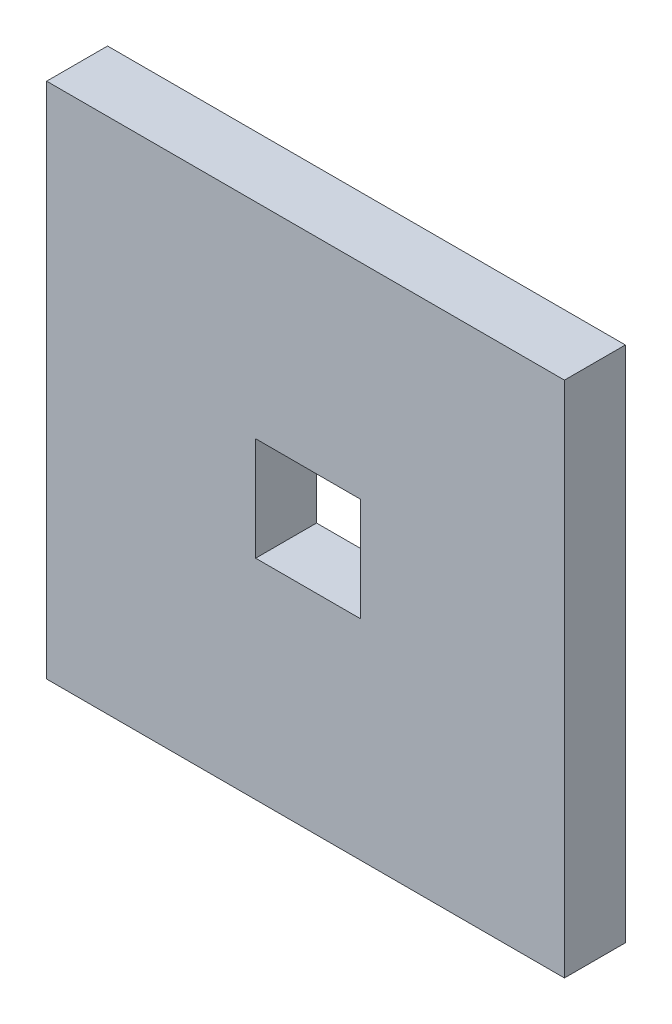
ISO-10303-21;
HEADER;
FILE_DESCRIPTION(('STEP AP214'),'2;1');
FILE_NAME('part.step','',(''),(''),'','','');
FILE_SCHEMA(('AUTOMOTIVE_DESIGN { 1 0 10303 214 1 1 1 1 }'));
ENDSEC;
DATA;
#1=APPLICATION_CONTEXT('core data for automotive mechanical design processes');
#2=APPLICATION_PROTOCOL_DEFINITION('international standard','automotive_design',2000,#1);
#3=PRODUCT_CONTEXT('',#1,'mechanical');
#4=PRODUCT('Part','Part','',(#3));
#5=PRODUCT_RELATED_PRODUCT_CATEGORY('part','',(#4));
#6=PRODUCT_DEFINITION_FORMATION('','',#4);
#7=PRODUCT_DEFINITION_CONTEXT('part definition',#1,'design');
#8=PRODUCT_DEFINITION('design','',#6,#7);
#9=PRODUCT_DEFINITION_SHAPE('','',#8);
#10=(LENGTH_UNIT() NAMED_UNIT(*) SI_UNIT(.MILLI.,.METRE.));
#11=(NAMED_UNIT(*) PLANE_ANGLE_UNIT() SI_UNIT($,.RADIAN.));
#12=(NAMED_UNIT(*) SI_UNIT($,.STERADIAN.) SOLID_ANGLE_UNIT());
#13=UNCERTAINTY_MEASURE_WITH_UNIT(LENGTH_MEASURE(1.E-05),#10,'distance_accuracy_value','');
#14=(GEOMETRIC_REPRESENTATION_CONTEXT(3) GLOBAL_UNCERTAINTY_ASSIGNED_CONTEXT((#13)) GLOBAL_UNIT_ASSIGNED_CONTEXT((#10,
#11,#12)) REPRESENTATION_CONTEXT('',''));
#15=CARTESIAN_POINT('',(0.,0.,0.));
#16=DIRECTION('',(0.,0.,1.));
#17=DIRECTION('',(1.,0.,0.));
#18=AXIS2_PLACEMENT_3D('',#15,#16,#17);
#19=CARTESIAN_POINT('',(0.,33.330286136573,-2.29));
#20=DIRECTION('',(1.,0.,0.));
#21=DIRECTION('',(0.,0.,-1.));
#22=AXIS2_PLACEMENT_3D('',#19,#20,#21);
#23=CYLINDRICAL_SURFACE('',#22,2.);
#24=DIRECTION('',(-1.,0.,0.));
#25=VECTOR('',#24,1.);
#26=CARTESIAN_POINT('',(0.,35.330286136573,-2.29));
#27=LINE('',#26,#25);
#28=CARTESIAN_POINT('',(-15.4503510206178,35.330286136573,-2.29));
#29=VERTEX_POINT('',#28);
#30=CARTESIAN_POINT('',(-20.4503510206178,35.330286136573,-2.29));
#31=VERTEX_POINT('',#30);
#32=EDGE_CURVE('E662',#29,#31,#27,.T.);
#33=ORIENTED_EDGE('',*,*,#32,.F.);
#34=CARTESIAN_POINT('',(-15.4503510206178,33.330286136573,-2.29));
#35=DIRECTION('',(1.,0.,0.));
#36=DIRECTION('',(0.,0.,-1.));
#37=AXIS2_PLACEMENT_3D('',#34,#35,#36);
#38=CIRCLE('',#37,2.);
#39=CARTESIAN_POINT('',(-15.4503510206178,33.330286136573,-0.29));
#40=VERTEX_POINT('',#39);
#41=EDGE_CURVE('E668',#40,#29,#38,.F.);
#42=ORIENTED_EDGE('',*,*,#41,.F.);
#43=DIRECTION('',(-1.,0.,0.));
#44=VECTOR('',#43,1.);
#45=CARTESIAN_POINT('',(0.,33.330286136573,-0.29));
#46=LINE('',#45,#44);
#47=CARTESIAN_POINT('',(-20.4503510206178,33.330286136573,-0.29));
#48=VERTEX_POINT('',#47);
#49=EDGE_CURVE('E665',#48,#40,#46,.F.);
#50=ORIENTED_EDGE('',*,*,#49,.F.);
#51=CARTESIAN_POINT('',(-20.4503510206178,33.330286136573,-2.29));
#52=DIRECTION('',(-1.,0.,0.));
#53=DIRECTION('',(0.,0.,1.));
#54=AXIS2_PLACEMENT_3D('',#51,#52,#53);
#55=CIRCLE('',#54,2.);
#56=EDGE_CURVE('E670',#31,#48,#55,.F.);
#57=ORIENTED_EDGE('',*,*,#56,.F.);
#58=EDGE_LOOP('',(#33,#42,#50,#57));
#59=FACE_BOUND('',#58,.T.);
#60=ADVANCED_FACE('F38',(#59),#23,.F.);
#61=CARTESIAN_POINT('',(-15.4503510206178,0.,-2.29));
#62=DIRECTION('',(0.,-1.,0.));
#63=DIRECTION('',(0.,0.,-1.));
#64=AXIS2_PLACEMENT_3D('',#61,#62,#63);
#65=CYLINDRICAL_SURFACE('',#64,2.);
#66=DIRECTION('',(0.,1.,0.));
#67=VECTOR('',#66,1.);
#68=CARTESIAN_POINT('',(-13.4503510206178,0.,-2.29));
#69=LINE('',#68,#67);
#70=CARTESIAN_POINT('',(-13.4503510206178,-26.669713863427,-2.29));
#71=VERTEX_POINT('',#70);
#72=CARTESIAN_POINT('',(-13.4503510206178,-21.669713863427,-2.29));
#73=VERTEX_POINT('',#72);
#74=EDGE_CURVE('E652',#71,#73,#69,.T.);
#75=ORIENTED_EDGE('',*,*,#74,.F.);
#76=CARTESIAN_POINT('',(-15.4503510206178,-26.669713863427,-2.29));
#77=DIRECTION('',(0.,-1.,0.));
#78=DIRECTION('',(0.,0.,-1.));
#79=AXIS2_PLACEMENT_3D('',#76,#77,#78);
#80=CIRCLE('',#79,2.);
#81=CARTESIAN_POINT('',(-15.4503510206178,-26.669713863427,-0.29));
#82=VERTEX_POINT('',#81);
#83=EDGE_CURVE('E658',#82,#71,#80,.F.);
#84=ORIENTED_EDGE('',*,*,#83,.F.);
#85=DIRECTION('',(0.,1.,0.));
#86=VECTOR('',#85,1.);
#87=CARTESIAN_POINT('',(-15.4503510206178,0.,-0.29));
#88=LINE('',#87,#86);
#89=CARTESIAN_POINT('',(-15.4503510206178,-21.669713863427,-0.29));
#90=VERTEX_POINT('',#89);
#91=EDGE_CURVE('E655',#90,#82,#88,.F.);
#92=ORIENTED_EDGE('',*,*,#91,.F.);
#93=CARTESIAN_POINT('',(-15.4503510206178,-21.669713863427,-2.29));
#94=DIRECTION('',(0.,1.,0.));
#95=DIRECTION('',(-1.,0.,0.));
#96=AXIS2_PLACEMENT_3D('',#93,#94,#95);
#97=CIRCLE('',#96,2.);
#98=EDGE_CURVE('E660',#73,#90,#97,.F.);
#99=ORIENTED_EDGE('',*,*,#98,.F.);
#100=EDGE_LOOP('',(#75,#84,#92,#99));
#101=FACE_BOUND('',#100,.T.);
#102=ADVANCED_FACE('F789',(#101),#65,.F.);
#103=CARTESIAN_POINT('',(0.,0.,-5.));
#104=DIRECTION('',(0.,0.,1.));
#105=DIRECTION('',(1.,0.,0.));
#106=AXIS2_PLACEMENT_3D('',#103,#104,#105);
#107=PLANE('',#106);
#108=DIRECTION('',(0.,1.,0.));
#109=VECTOR('',#108,1.);
#110=CARTESIAN_POINT('',(-79.4503510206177,-30.669713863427,-5.));
#111=LINE('',#110,#109);
#112=CARTESIAN_POINT('',(-79.4503510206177,-30.669713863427,-5.));
#113=VERTEX_POINT('',#112);
#114=CARTESIAN_POINT('',(-79.4503510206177,37.330286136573,-5.));
#115=VERTEX_POINT('',#114);
#116=EDGE_CURVE('E429',#113,#115,#111,.T.);
#117=ORIENTED_EDGE('',*,*,#116,.T.);
#118=DIRECTION('',(1.,0.,0.));
#119=VECTOR('',#118,1.);
#120=CARTESIAN_POINT('',(-79.4503510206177,37.330286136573,-5.));
#121=LINE('',#120,#119);
#122=CARTESIAN_POINT('',(-11.4503510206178,37.330286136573,-5.));
#123=VERTEX_POINT('',#122);
#124=EDGE_CURVE('E434',#115,#123,#121,.T.);
#125=ORIENTED_EDGE('',*,*,#124,.T.);
#126=DIRECTION('',(0.,-1.,0.));
#127=VECTOR('',#126,1.);
#128=CARTESIAN_POINT('',(-11.4503510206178,-30.669713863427,-5.));
#129=LINE('',#128,#127);
#130=CARTESIAN_POINT('',(-11.4503510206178,-30.669713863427,-5.));
#131=VERTEX_POINT('',#130);
#132=EDGE_CURVE('E432',#123,#131,#129,.T.);
#133=ORIENTED_EDGE('',*,*,#132,.T.);
#134=DIRECTION('',(-1.,0.,0.));
#135=VECTOR('',#134,1.);
#136=CARTESIAN_POINT('',(-79.4503510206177,-30.669713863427,-5.));
#137=LINE('',#136,#135);
#138=EDGE_CURVE('E422',#131,#113,#137,.T.);
#139=ORIENTED_EDGE('',*,*,#138,.T.);
#140=EDGE_LOOP('',(#117,#125,#133,#139));
#141=FACE_BOUND('',#140,.T.);
#142=DIRECTION('',(1.,0.,0.));
#143=VECTOR('',#142,1.);
#144=CARTESIAN_POINT('',(0.,-28.669713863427,-5.));
#145=LINE('',#144,#143);
#146=CARTESIAN_POINT('',(-75.4503510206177,-28.669713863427,-5.));
#147=VERTEX_POINT('',#146);
#148=CARTESIAN_POINT('',(-70.4503510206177,-28.669713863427,-5.));
#149=VERTEX_POINT('',#148);
#150=EDGE_CURVE('E371',#147,#149,#145,.T.);
#151=ORIENTED_EDGE('',*,*,#150,.T.);
#152=DIRECTION('',(0.,-1.,0.));
#153=VECTOR('',#152,1.);
#154=CARTESIAN_POINT('',(-70.4503510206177,0.,-5.));
#155=LINE('',#154,#153);
#156=CARTESIAN_POINT('',(-70.4503510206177,-26.669713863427,-5.));
#157=VERTEX_POINT('',#156);
#158=EDGE_CURVE('E342',#157,#149,#155,.T.);
#159=ORIENTED_EDGE('',*,*,#158,.F.);
#160=DIRECTION('',(-1.,0.,0.));
#161=VECTOR('',#160,1.);
#162=CARTESIAN_POINT('',(-75.4503510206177,-26.669713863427,-5.));
#163=LINE('',#162,#161);
#164=CARTESIAN_POINT('',(-13.4503510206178,-26.669713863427,-5.));
#165=VERTEX_POINT('',#164);
#166=EDGE_CURVE('E435',#165,#157,#163,.T.);
#167=ORIENTED_EDGE('',*,*,#166,.F.);
#168=DIRECTION('',(0.,1.,0.));
#169=VECTOR('',#168,1.);
#170=CARTESIAN_POINT('',(-13.4503510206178,0.,-5.));
#171=LINE('',#170,#169);
#172=CARTESIAN_POINT('',(-13.4503510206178,-21.669713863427,-5.));
#173=VERTEX_POINT('',#172);
#174=EDGE_CURVE('E403',#165,#173,#171,.T.);
#175=ORIENTED_EDGE('',*,*,#174,.T.);
#176=DIRECTION('',(1.,0.,0.));
#177=VECTOR('',#176,1.);
#178=CARTESIAN_POINT('',(0.,-21.669713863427,-5.));
#179=LINE('',#178,#177);
#180=CARTESIAN_POINT('',(-15.4503510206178,-21.669713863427,-5.));
#181=VERTEX_POINT('',#180);
#182=EDGE_CURVE('E409',#181,#173,#179,.T.);
#183=ORIENTED_EDGE('',*,*,#182,.F.);
#184=DIRECTION('',(0.,-1.,0.));
#185=VECTOR('',#184,1.);
#186=CARTESIAN_POINT('',(-15.4503510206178,-26.669713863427,-5.));
#187=LINE('',#186,#185);
#188=CARTESIAN_POINT('',(-15.4503510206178,35.330286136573,-5.));
#189=VERTEX_POINT('',#188);
#190=EDGE_CURVE('E419',#189,#181,#187,.T.);
#191=ORIENTED_EDGE('',*,*,#190,.F.);
#192=DIRECTION('',(-1.,0.,0.));
#193=VECTOR('',#192,1.);
#194=CARTESIAN_POINT('',(0.,35.330286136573,-5.));
#195=LINE('',#194,#193);
#196=CARTESIAN_POINT('',(-20.4503510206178,35.330286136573,-5.));
#197=VERTEX_POINT('',#196);
#198=EDGE_CURVE('E397',#189,#197,#195,.T.);
#199=ORIENTED_EDGE('',*,*,#198,.T.);
#200=DIRECTION('',(0.,1.,0.));
#201=VECTOR('',#200,1.);
#202=CARTESIAN_POINT('',(-20.4503510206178,0.,-5.));
#203=LINE('',#202,#201);
#204=CARTESIAN_POINT('',(-20.4503510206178,33.330286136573,-5.));
#205=VERTEX_POINT('',#204);
#206=EDGE_CURVE('E386',#205,#197,#203,.T.);
#207=ORIENTED_EDGE('',*,*,#206,.F.);
#208=DIRECTION('',(1.,0.,0.));
#209=VECTOR('',#208,1.);
#210=CARTESIAN_POINT('',(-75.4503510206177,33.330286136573,-5.));
#211=LINE('',#210,#209);
#212=CARTESIAN_POINT('',(-77.4503510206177,33.330286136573,-5.));
#213=VERTEX_POINT('',#212);
#214=EDGE_CURVE('E423',#213,#205,#211,.T.);
#215=ORIENTED_EDGE('',*,*,#214,.F.);
#216=DIRECTION('',(0.,-1.,0.));
#217=VECTOR('',#216,1.);
#218=CARTESIAN_POINT('',(-77.4503510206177,0.,-5.));
#219=LINE('',#218,#217);
#220=CARTESIAN_POINT('',(-77.4503510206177,28.330286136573,-5.));
#221=VERTEX_POINT('',#220);
#222=EDGE_CURVE('E388',#213,#221,#219,.T.);
#223=ORIENTED_EDGE('',*,*,#222,.T.);
#224=DIRECTION('',(-1.,0.,0.));
#225=VECTOR('',#224,1.);
#226=CARTESIAN_POINT('',(0.,28.330286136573,-5.));
#227=LINE('',#226,#225);
#228=CARTESIAN_POINT('',(-75.4503510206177,28.330286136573,-5.));
#229=VERTEX_POINT('',#228);
#230=EDGE_CURVE('E383',#229,#221,#227,.T.);
#231=ORIENTED_EDGE('',*,*,#230,.F.);
#232=DIRECTION('',(0.,1.,0.));
#233=VECTOR('',#232,1.);
#234=CARTESIAN_POINT('',(-75.4503510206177,-26.669713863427,-5.));
#235=LINE('',#234,#233);
#236=EDGE_CURVE('E426',#147,#229,#235,.T.);
#237=ORIENTED_EDGE('',*,*,#236,.F.);
#238=EDGE_LOOP('',(#151,#159,#167,#175,#183,#191,#199,#207,#215,#223,#231,#237));
#239=FACE_BOUND('',#238,.T.);
#240=ADVANCED_FACE('F713',(#141,#239),#107,.F.);
#241=CARTESIAN_POINT('',(0.,0.,-0.29));
#242=DIRECTION('',(0.,0.,-1.));
#243=DIRECTION('',(-1.,0.,0.));
#244=AXIS2_PLACEMENT_3D('',#241,#242,#243);
#245=PLANE('',#244);
#246=DIRECTION('',(0.,-1.,0.));
#247=VECTOR('',#246,1.);
#248=CARTESIAN_POINT('',(-15.4503510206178,33.330286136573,-0.29));
#249=LINE('',#248,#247);
#250=CARTESIAN_POINT('',(-15.4503510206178,-2.82335435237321,-0.29));
#251=VERTEX_POINT('',#250);
#252=EDGE_CURVE('E513',#251,#90,#249,.T.);
#253=ORIENTED_EDGE('',*,*,#252,.T.);
#254=ORIENTED_EDGE('',*,*,#91,.T.);
#255=DIRECTION('',(-1.,0.,0.));
#256=VECTOR('',#255,1.);
#257=CARTESIAN_POINT('',(-15.4503510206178,-26.669713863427,-0.29));
#258=LINE('',#257,#256);
#259=CARTESIAN_POINT('',(-34.3902625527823,-26.669713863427,-0.29));
#260=VERTEX_POINT('',#259);
#261=EDGE_CURVE('E516',#82,#260,#258,.T.);
#262=ORIENTED_EDGE('',*,*,#261,.T.);
#263=DIRECTION('',(0.,1.,0.));
#264=VECTOR('',#263,1.);
#265=CARTESIAN_POINT('',(-34.3902625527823,14.2770149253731,-0.29));
#266=LINE('',#265,#264);
#267=CARTESIAN_POINT('',(-34.3902625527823,-7.21335435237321,-0.29));
#268=VERTEX_POINT('',#267);
#269=EDGE_CURVE('E506',#260,#268,#266,.T.);
#270=ORIENTED_EDGE('',*,*,#269,.T.);
#271=DIRECTION('',(0.,1.,0.));
#272=VECTOR('',#271,1.);
#273=CARTESIAN_POINT('',(-34.3902625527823,0.,-0.29));
#274=LINE('',#273,#272);
#275=CARTESIAN_POINT('',(-34.3902625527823,-3.6099348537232,-0.29));
#276=VERTEX_POINT('',#275);
#277=EDGE_CURVE('E644',#268,#276,#274,.T.);
#278=ORIENTED_EDGE('',*,*,#277,.T.);
#279=CARTESIAN_POINT('',(-34.3902625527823,-2.61335435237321,-0.29));
#280=DIRECTION('',(0.,0.,-1.));
#281=DIRECTION('',(-1.,0.,0.));
#282=AXIS2_PLACEMENT_3D('',#279,#280,#281);
#283=CIRCLE('',#282,0.996580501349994);
#284=CARTESIAN_POINT('',(-33.4160589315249,-2.82335435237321,-0.29));
#285=VERTEX_POINT('',#284);
#286=EDGE_CURVE('E468',#276,#285,#283,.F.);
#287=ORIENTED_EDGE('',*,*,#286,.T.);
#288=DIRECTION('',(-1.,0.,0.));
#289=VECTOR('',#288,1.);
#290=CARTESIAN_POINT('',(0.,-2.82335435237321,-0.29));
#291=LINE('',#290,#289);
#292=EDGE_CURVE('E647',#251,#285,#291,.T.);
#293=ORIENTED_EDGE('',*,*,#292,.F.);
#294=EDGE_LOOP('',(#253,#254,#262,#270,#278,#287,#293));
#295=FACE_BOUND('',#294,.T.);
#296=ADVANCED_FACE('F854',(#295),#245,.T.);
#297=DIRECTION('',(1.,0.,0.));
#298=VECTOR('',#297,1.);
#299=CARTESIAN_POINT('',(-34.3902625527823,33.330286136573,-0.29));
#300=LINE('',#299,#298);
#301=CARTESIAN_POINT('',(-34.3902625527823,33.330286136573,-0.29));
#302=VERTEX_POINT('',#301);
#303=EDGE_CURVE('E509',#302,#48,#300,.T.);
#304=ORIENTED_EDGE('',*,*,#303,.T.);
#305=ORIENTED_EDGE('',*,*,#49,.T.);
#306=CARTESIAN_POINT('',(-15.4503510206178,-2.40335435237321,-0.29));
#307=VERTEX_POINT('',#306);
#308=EDGE_CURVE('E514',#40,#307,#249,.T.);
#309=ORIENTED_EDGE('',*,*,#308,.T.);
#310=DIRECTION('',(-1.,0.,0.));
#311=VECTOR('',#310,1.);
#312=CARTESIAN_POINT('',(0.,-2.40335435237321,-0.29));
#313=LINE('',#312,#311);
#314=CARTESIAN_POINT('',(-33.4160589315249,-2.40335435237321,-0.29));
#315=VERTEX_POINT('',#314);
#316=EDGE_CURVE('E650',#307,#315,#313,.T.);
#317=ORIENTED_EDGE('',*,*,#316,.T.);
#318=CARTESIAN_POINT('',(-34.3902625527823,-1.61677385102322,-0.29));
#319=VERTEX_POINT('',#318);
#320=EDGE_CURVE('E466',#315,#319,#283,.F.);
#321=ORIENTED_EDGE('',*,*,#320,.T.);
#322=CARTESIAN_POINT('',(-34.3902625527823,14.2770149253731,-0.29));
#323=VERTEX_POINT('',#322);
#324=EDGE_CURVE('E642',#319,#323,#274,.T.);
#325=ORIENTED_EDGE('',*,*,#324,.T.);
#326=EDGE_CURVE('E510',#323,#302,#266,.T.);
#327=ORIENTED_EDGE('',*,*,#326,.T.);
#328=EDGE_LOOP('',(#304,#305,#309,#317,#321,#325,#327));
#329=FACE_BOUND('',#328,.T.);
#330=ADVANCED_FACE('F719',(#329),#245,.T.);
#331=CARTESIAN_POINT('',(-34.3902625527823,0.,3.));
#332=DIRECTION('',(1.,0.,0.));
#333=DIRECTION('',(0.,0.,-1.));
#334=AXIS2_PLACEMENT_3D('',#331,#332,#333);
#335=PLANE('',#334);
#336=ORIENTED_EDGE('',*,*,#324,.F.);
#337=DIRECTION('',(0.,0.,1.));
#338=VECTOR('',#337,1.);
#339=CARTESIAN_POINT('',(-34.3902625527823,-1.61677385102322,-7.22842174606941));
#340=LINE('',#339,#338);
#341=CARTESIAN_POINT('',(-34.3902625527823,-1.61677385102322,-5.));
#342=VERTEX_POINT('',#341);
#343=EDGE_CURVE('E460',#342,#319,#340,.T.);
#344=ORIENTED_EDGE('',*,*,#343,.F.);
#345=DIRECTION('',(0.,-1.,0.));
#346=VECTOR('',#345,1.);
#347=CARTESIAN_POINT('',(-34.3902625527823,0.,-5.));
#348=LINE('',#347,#346);
#349=CARTESIAN_POINT('',(-34.3902625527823,14.2770149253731,-5.));
#350=VERTEX_POINT('',#349);
#351=EDGE_CURVE('E608',#350,#342,#348,.T.);
#352=ORIENTED_EDGE('',*,*,#351,.F.);
#353=DIRECTION('',(0.,0.,-1.));
#354=VECTOR('',#353,1.);
#355=CARTESIAN_POINT('',(-34.3902625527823,14.2770149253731,3.));
#356=LINE('',#355,#354);
#357=EDGE_CURVE('E611',#323,#350,#356,.T.);
#358=ORIENTED_EDGE('',*,*,#357,.F.);
#359=EDGE_LOOP('',(#336,#344,#352,#358));
#360=FACE_BOUND('',#359,.T.);
#361=ADVANCED_FACE('F924',(#360),#335,.T.);
#362=CARTESIAN_POINT('',(-34.3902625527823,-3.6099348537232,-5.));
#363=VERTEX_POINT('',#362);
#364=CARTESIAN_POINT('',(-34.3902625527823,-7.21335435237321,-5.));
#365=VERTEX_POINT('',#364);
#366=EDGE_CURVE('E607',#363,#365,#348,.T.);
#367=ORIENTED_EDGE('',*,*,#366,.F.);
#368=DIRECTION('',(0.,0.,1.));
#369=VECTOR('',#368,1.);
#370=CARTESIAN_POINT('',(-34.3902625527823,-3.6099348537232,-7.22842174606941));
#371=LINE('',#370,#369);
#372=EDGE_CURVE('E431',#363,#276,#371,.T.);
#373=ORIENTED_EDGE('',*,*,#372,.T.);
#374=ORIENTED_EDGE('',*,*,#277,.F.);
#375=DIRECTION('',(0.,0.,-1.));
#376=VECTOR('',#375,1.);
#377=CARTESIAN_POINT('',(-34.3902625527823,-7.21335435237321,3.));
#378=LINE('',#377,#376);
#379=EDGE_CURVE('E615',#268,#365,#378,.T.);
#380=ORIENTED_EDGE('',*,*,#379,.T.);
#381=EDGE_LOOP('',(#367,#373,#374,#380));
#382=FACE_BOUND('',#381,.T.);
#383=ADVANCED_FACE('F927',(#382),#335,.T.);
#384=CARTESIAN_POINT('',(0.,0.,0.));
#385=DIRECTION('',(0.,0.,1.));
#386=DIRECTION('',(1.,0.,0.));
#387=AXIS2_PLACEMENT_3D('',#384,#385,#386);
#388=PLANE('',#387);
#389=DIRECTION('',(1.,0.,0.));
#390=VECTOR('',#389,1.);
#391=CARTESIAN_POINT('',(-75.4503510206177,-26.669713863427,0.));
#392=LINE('',#391,#390);
#393=CARTESIAN_POINT('',(-70.4503510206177,-26.669713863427,0.));
#394=VERTEX_POINT('',#393);
#395=CARTESIAN_POINT('',(-34.3902625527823,-26.669713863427,0.));
#396=VERTEX_POINT('',#395);
#397=EDGE_CURVE('E637',#394,#396,#392,.T.);
#398=ORIENTED_EDGE('',*,*,#397,.F.);
#399=DIRECTION('',(1.,0.,0.));
#400=VECTOR('',#399,1.);
#401=CARTESIAN_POINT('',(0.,-26.669713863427,0.));
#402=LINE('',#401,#400);
#403=CARTESIAN_POINT('',(-75.4503510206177,-26.669713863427,0.));
#404=VERTEX_POINT('',#403);
#405=EDGE_CURVE('E679',#394,#404,#402,.F.);
#406=ORIENTED_EDGE('',*,*,#405,.T.);
#407=DIRECTION('',(0.,-1.,0.));
#408=VECTOR('',#407,1.);
#409=CARTESIAN_POINT('',(-75.4503510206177,33.330286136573,0.));
#410=LINE('',#409,#408);
#411=CARTESIAN_POINT('',(-75.4503510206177,28.330286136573,0.));
#412=VERTEX_POINT('',#411);
#413=EDGE_CURVE('E634',#412,#404,#410,.T.);
#414=ORIENTED_EDGE('',*,*,#413,.F.);
#415=DIRECTION('',(0.,-1.,0.));
#416=VECTOR('',#415,1.);
#417=CARTESIAN_POINT('',(-75.4503510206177,0.,0.));
#418=LINE('',#417,#416);
#419=CARTESIAN_POINT('',(-75.4503510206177,33.330286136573,0.));
#420=VERTEX_POINT('',#419);
#421=EDGE_CURVE('E677',#412,#420,#418,.F.);
#422=ORIENTED_EDGE('',*,*,#421,.T.);
#423=DIRECTION('',(-1.,0.,0.));
#424=VECTOR('',#423,1.);
#425=CARTESIAN_POINT('',(-75.4503510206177,33.330286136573,0.));
#426=LINE('',#425,#424);
#427=CARTESIAN_POINT('',(-67.3413083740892,33.330286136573,0.));
#428=VERTEX_POINT('',#427);
#429=EDGE_CURVE('E639',#428,#420,#426,.T.);
#430=ORIENTED_EDGE('',*,*,#429,.F.);
#431=DIRECTION('',(0.587785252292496,-0.809016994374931,0.));
#432=VECTOR('',#431,1.);
#433=CARTESIAN_POINT('',(-28.2259656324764,-20.507364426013,0.));
#434=LINE('',#433,#432);
#435=CARTESIAN_POINT('',(-53.792973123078,14.6826024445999,0.));
#436=VERTEX_POINT('',#435);
#437=EDGE_CURVE('E526',#428,#436,#434,.T.);
#438=ORIENTED_EDGE('',*,*,#437,.T.);
#439=CARTESIAN_POINT('',(-52.880262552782,14.2770149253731,0.));
#440=DIRECTION('',(0.,0.,-1.));
#441=DIRECTION('',(-1.,0.,0.));
#442=AXIS2_PLACEMENT_3D('',#439,#440,#441);
#443=CIRCLE('',#442,0.998770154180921);
#444=CARTESIAN_POINT('',(-53.8790327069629,14.2770149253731,0.));
#445=VERTEX_POINT('',#444);
#446=EDGE_CURVE('E469',#445,#436,#443,.T.);
#447=ORIENTED_EDGE('',*,*,#446,.F.);
#448=DIRECTION('',(-1.,0.,0.));
#449=VECTOR('',#448,1.);
#450=CARTESIAN_POINT('',(-34.3902625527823,14.2770149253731,0.));
#451=LINE('',#450,#449);
#452=CARTESIAN_POINT('',(-55.8802625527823,14.2770149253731,0.));
#453=VERTEX_POINT('',#452);
#454=EDGE_CURVE('E624',#445,#453,#451,.T.);
#455=ORIENTED_EDGE('',*,*,#454,.T.);
#456=DIRECTION('',(0.,-1.,0.));
#457=VECTOR('',#456,1.);
#458=CARTESIAN_POINT('',(-55.8802625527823,14.2770149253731,0.));
#459=LINE('',#458,#457);
#460=CARTESIAN_POINT('',(-55.8802625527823,-7.21335435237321,0.));
#461=VERTEX_POINT('',#460);
#462=EDGE_CURVE('E628',#453,#461,#459,.T.);
#463=ORIENTED_EDGE('',*,*,#462,.T.);
#464=DIRECTION('',(1.,0.,0.));
#465=VECTOR('',#464,1.);
#466=CARTESIAN_POINT('',(-34.3902625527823,-7.21335435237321,0.));
#467=LINE('',#466,#465);
#468=CARTESIAN_POINT('',(-34.3902625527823,-7.21335435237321,0.));
#469=VERTEX_POINT('',#468);
#470=EDGE_CURVE('E631',#461,#469,#467,.T.);
#471=ORIENTED_EDGE('',*,*,#470,.T.);
#472=DIRECTION('',(0.,1.,0.));
#473=VECTOR('',#472,1.);
#474=CARTESIAN_POINT('',(-34.3902625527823,-7.21335435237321,0.));
#475=LINE('',#474,#473);
#476=EDGE_CURVE('E519',#396,#469,#475,.T.);
#477=ORIENTED_EDGE('',*,*,#476,.F.);
#478=EDGE_LOOP('',(#398,#406,#414,#422,#430,#438,#447,#455,#463,#471,#477));
#479=FACE_BOUND('',#478,.T.);
#480=ADVANCED_FACE('F700',(#479),#388,.F.);
#481=CARTESIAN_POINT('',(-51.9674583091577,14.6823915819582,0.));
#482=VERTEX_POINT('',#481);
#483=CARTESIAN_POINT('',(-51.8814923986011,14.2770149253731,0.));
#484=VERTEX_POINT('',#483);
#485=EDGE_CURVE('E473',#482,#484,#443,.T.);
#486=ORIENTED_EDGE('',*,*,#485,.F.);
#487=DIRECTION('',(0.587972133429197,0.808881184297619,0.));
#488=VECTOR('',#487,1.);
#489=CARTESIAN_POINT('',(-40.9846638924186,29.7915698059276,0.));
#490=LINE('',#489,#488);
#491=CARTESIAN_POINT('',(-38.4123867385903,33.330286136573,0.));
#492=VERTEX_POINT('',#491);
#493=EDGE_CURVE('E531',#482,#492,#490,.T.);
#494=ORIENTED_EDGE('',*,*,#493,.T.);
#495=CARTESIAN_POINT('',(-34.3902625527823,33.330286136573,0.));
#496=VERTEX_POINT('',#495);
#497=EDGE_CURVE('E640',#496,#492,#426,.T.);
#498=ORIENTED_EDGE('',*,*,#497,.F.);
#499=CARTESIAN_POINT('',(-34.3902625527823,14.2770149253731,0.));
#500=VERTEX_POINT('',#499);
#501=EDGE_CURVE('E505',#500,#496,#475,.T.);
#502=ORIENTED_EDGE('',*,*,#501,.F.);
#503=EDGE_CURVE('E625',#500,#484,#451,.T.);
#504=ORIENTED_EDGE('',*,*,#503,.T.);
#505=EDGE_LOOP('',(#486,#494,#498,#502,#504));
#506=FACE_BOUND('',#505,.T.);
#507=ADVANCED_FACE('F731',(#506),#388,.F.);
#508=CARTESIAN_POINT('',(0.,14.2770149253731,3.));
#509=DIRECTION('',(0.,-1.,0.));
#510=DIRECTION('',(1.,0.,0.));
#511=AXIS2_PLACEMENT_3D('',#508,#509,#510);
#512=PLANE('',#511);
#513=DIRECTION('',(0.,0.,1.));
#514=VECTOR('',#513,1.);
#515=CARTESIAN_POINT('',(-51.8814923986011,14.2770149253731,-7.23331795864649));
#516=LINE('',#515,#514);
#517=CARTESIAN_POINT('',(-51.8814923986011,14.2770149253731,-5.));
#518=VERTEX_POINT('',#517);
#519=EDGE_CURVE('E472',#518,#484,#516,.T.);
#520=ORIENTED_EDGE('',*,*,#519,.T.);
#521=ORIENTED_EDGE('',*,*,#503,.F.);
#522=EDGE_CURVE('E612',#500,#323,#356,.T.);
#523=ORIENTED_EDGE('',*,*,#522,.T.);
#524=ORIENTED_EDGE('',*,*,#357,.T.);
#525=DIRECTION('',(-1.,0.,0.));
#526=VECTOR('',#525,1.);
#527=CARTESIAN_POINT('',(0.,14.2770149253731,-5.));
#528=LINE('',#527,#526);
#529=EDGE_CURVE('E599',#350,#518,#528,.T.);
#530=ORIENTED_EDGE('',*,*,#529,.T.);
#531=EDGE_LOOP('',(#520,#521,#523,#524,#530));
#532=FACE_BOUND('',#531,.T.);
#533=ADVANCED_FACE('F782',(#532),#512,.F.);
#534=DIRECTION('',(0.,0.,1.));
#535=VECTOR('',#534,1.);
#536=CARTESIAN_POINT('',(-53.8790327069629,14.2770149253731,-7.23331795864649));
#537=LINE('',#536,#535);
#538=CARTESIAN_POINT('',(-53.8790327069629,14.2770149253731,-5.));
#539=VERTEX_POINT('',#538);
#540=EDGE_CURVE('E475',#539,#445,#537,.T.);
#541=ORIENTED_EDGE('',*,*,#540,.F.);
#542=CARTESIAN_POINT('',(-55.8802625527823,14.2770149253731,-5.));
#543=VERTEX_POINT('',#542);
#544=EDGE_CURVE('E598',#539,#543,#528,.T.);
#545=ORIENTED_EDGE('',*,*,#544,.T.);
#546=DIRECTION('',(0.,0.,-1.));
#547=VECTOR('',#546,1.);
#548=CARTESIAN_POINT('',(-55.8802625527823,14.2770149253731,3.));
#549=LINE('',#548,#547);
#550=EDGE_CURVE('E621',#453,#543,#549,.T.);
#551=ORIENTED_EDGE('',*,*,#550,.F.);
#552=ORIENTED_EDGE('',*,*,#454,.F.);
#553=EDGE_LOOP('',(#541,#545,#551,#552));
#554=FACE_BOUND('',#553,.T.);
#555=ADVANCED_FACE('F775',(#554),#512,.F.);
#556=DIRECTION('',(0.,1.,0.));
#557=VECTOR('',#556,1.);
#558=CARTESIAN_POINT('',(-53.380262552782,0.,0.));
#559=LINE('',#558,#557);
#560=CARTESIAN_POINT('',(-53.380262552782,15.8158566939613,0.));
#561=VERTEX_POINT('',#560);
#562=CARTESIAN_POINT('',(-53.380262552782,33.330286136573,0.));
#563=VERTEX_POINT('',#562);
#564=EDGE_CURVE('E564',#561,#563,#559,.T.);
#565=ORIENTED_EDGE('',*,*,#564,.F.);
#566=DIRECTION('',(-0.587785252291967,0.809016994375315,0.));
#567=VECTOR('',#566,1.);
#568=CARTESIAN_POINT('',(-27.4169486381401,-19.9195791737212,0.));
#569=LINE('',#568,#567);
#570=CARTESIAN_POINT('',(-66.1052403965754,33.330286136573,0.));
#571=VERTEX_POINT('',#570);
#572=EDGE_CURVE('E561',#561,#571,#569,.T.);
#573=ORIENTED_EDGE('',*,*,#572,.T.);
#574=EDGE_CURVE('E769',#563,#571,#426,.T.);
#575=ORIENTED_EDGE('',*,*,#574,.F.);
#576=EDGE_LOOP('',(#565,#573,#575));
#577=FACE_BOUND('',#576,.T.);
#578=ADVANCED_FACE('F772',(#577),#388,.F.);
#579=DIRECTION('',(-0.587972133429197,-0.808881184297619,0.));
#580=VECTOR('',#579,1.);
#581=CARTESIAN_POINT('',(-41.7903822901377,30.377242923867,0.));
#582=LINE('',#581,#580);
#583=CARTESIAN_POINT('',(-39.6438283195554,33.330286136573,0.));
#584=VERTEX_POINT('',#583);
#585=CARTESIAN_POINT('',(-52.380262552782,15.8086019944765,0.));
#586=VERTEX_POINT('',#585);
#587=EDGE_CURVE('E570',#584,#586,#582,.T.);
#588=ORIENTED_EDGE('',*,*,#587,.T.);
#589=DIRECTION('',(0.,1.,0.));
#590=VECTOR('',#589,1.);
#591=CARTESIAN_POINT('',(-52.380262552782,0.,0.));
#592=LINE('',#591,#590);
#593=CARTESIAN_POINT('',(-52.380262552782,33.330286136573,0.));
#594=VERTEX_POINT('',#593);
#595=EDGE_CURVE('E567',#586,#594,#592,.T.);
#596=ORIENTED_EDGE('',*,*,#595,.T.);
#597=EDGE_CURVE('E643',#584,#594,#426,.T.);
#598=ORIENTED_EDGE('',*,*,#597,.F.);
#599=EDGE_LOOP('',(#588,#596,#598));
#600=FACE_BOUND('',#599,.T.);
#601=ADVANCED_FACE('F774',(#600),#388,.F.);
#602=CARTESIAN_POINT('',(0.,-7.21335435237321,3.));
#603=DIRECTION('',(0.,-1.,0.));
#604=DIRECTION('',(0.,0.,-1.));
#605=AXIS2_PLACEMENT_3D('',#602,#603,#604);
#606=PLANE('',#605);
#607=ORIENTED_EDGE('',*,*,#470,.F.);
#608=DIRECTION('',(0.,0.,-1.));
#609=VECTOR('',#608,1.);
#610=CARTESIAN_POINT('',(-55.8802625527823,-7.21335435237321,3.));
#611=LINE('',#610,#609);
#612=CARTESIAN_POINT('',(-55.8802625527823,-7.21335435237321,-5.));
#613=VERTEX_POINT('',#612);
#614=EDGE_CURVE('E619',#461,#613,#611,.T.);
#615=ORIENTED_EDGE('',*,*,#614,.T.);
#616=DIRECTION('',(-1.,0.,0.));
#617=VECTOR('',#616,1.);
#618=CARTESIAN_POINT('',(0.,-7.21335435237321,-5.));
#619=LINE('',#618,#617);
#620=EDGE_CURVE('E604',#365,#613,#619,.T.);
#621=ORIENTED_EDGE('',*,*,#620,.F.);
#622=ORIENTED_EDGE('',*,*,#379,.F.);
#623=EDGE_CURVE('E616',#469,#268,#378,.T.);
#624=ORIENTED_EDGE('',*,*,#623,.F.);
#625=EDGE_LOOP('',(#607,#615,#621,#622,#624));
#626=FACE_BOUND('',#625,.T.);
#627=ADVANCED_FACE('F781',(#626),#606,.T.);
#628=CARTESIAN_POINT('',(-55.8802625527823,0.,3.));
#629=DIRECTION('',(1.,0.,0.));
#630=DIRECTION('',(0.,0.,-1.));
#631=AXIS2_PLACEMENT_3D('',#628,#629,#630);
#632=PLANE('',#631);
#633=ORIENTED_EDGE('',*,*,#614,.F.);
#634=ORIENTED_EDGE('',*,*,#462,.F.);
#635=ORIENTED_EDGE('',*,*,#550,.T.);
#636=DIRECTION('',(0.,-1.,0.));
#637=VECTOR('',#636,1.);
#638=CARTESIAN_POINT('',(-55.8802625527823,0.,-5.));
#639=LINE('',#638,#637);
#640=EDGE_CURVE('E601',#543,#613,#639,.T.);
#641=ORIENTED_EDGE('',*,*,#640,.T.);
#642=EDGE_LOOP('',(#633,#634,#635,#641));
#643=FACE_BOUND('',#642,.T.);
#644=ADVANCED_FACE('F922',(#643),#632,.F.);
#645=CARTESIAN_POINT('',(0.,0.,-5.));
#646=DIRECTION('',(0.,0.,1.));
#647=DIRECTION('',(1.,0.,0.));
#648=AXIS2_PLACEMENT_3D('',#645,#646,#647);
#649=PLANE('',#648);
#650=DIRECTION('',(-1.,0.,0.));
#651=VECTOR('',#650,1.);
#652=CARTESIAN_POINT('',(-38.2419433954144,-3.20216394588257,-5.));
#653=LINE('',#652,#651);
#654=CARTESIAN_POINT('',(-38.2419433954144,-3.20216394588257,-5.));
#655=VERTEX_POINT('',#654);
#656=CARTESIAN_POINT('',(-52.0044054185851,-3.20216394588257,-5.));
#657=VERTEX_POINT('',#656);
#658=EDGE_CURVE('E355',#655,#657,#653,.T.);
#659=ORIENTED_EDGE('',*,*,#658,.F.);
#660=DIRECTION('',(0.,-1.,0.));
#661=VECTOR('',#660,1.);
#662=CARTESIAN_POINT('',(-38.2419433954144,10.3893849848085,-5.));
#663=LINE('',#662,#661);
#664=CARTESIAN_POINT('',(-38.2419433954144,10.3893849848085,-5.));
#665=VERTEX_POINT('',#664);
#666=EDGE_CURVE('E53',#665,#655,#663,.T.);
#667=ORIENTED_EDGE('',*,*,#666,.F.);
#668=DIRECTION('',(1.,0.,0.));
#669=VECTOR('',#668,1.);
#670=CARTESIAN_POINT('',(-38.2419433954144,10.3893849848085,-5.));
#671=LINE('',#670,#669);
#672=CARTESIAN_POINT('',(-52.0044054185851,10.3893849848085,-5.));
#673=VERTEX_POINT('',#672);
#674=EDGE_CURVE('E348',#673,#665,#671,.T.);
#675=ORIENTED_EDGE('',*,*,#674,.F.);
#676=DIRECTION('',(0.,1.,0.));
#677=VECTOR('',#676,1.);
#678=CARTESIAN_POINT('',(-52.0044054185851,10.3893849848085,-5.));
#679=LINE('',#678,#677);
#680=EDGE_CURVE('E362',#657,#673,#679,.T.);
#681=ORIENTED_EDGE('',*,*,#680,.F.);
#682=EDGE_LOOP('',(#659,#667,#675,#681));
#683=FACE_BOUND('',#682,.T.);
#684=ORIENTED_EDGE('',*,*,#529,.F.);
#685=ORIENTED_EDGE('',*,*,#351,.T.);
#686=CARTESIAN_POINT('',(-34.3902625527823,-2.61335435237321,-5.));
#687=DIRECTION('',(0.,0.,1.));
#688=DIRECTION('',(1.,0.,0.));
#689=AXIS2_PLACEMENT_3D('',#686,#687,#688);
#690=CIRCLE('',#689,0.996580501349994);
#691=EDGE_CURVE('E463',#363,#342,#690,.T.);
#692=ORIENTED_EDGE('',*,*,#691,.F.);
#693=ORIENTED_EDGE('',*,*,#366,.T.);
#694=ORIENTED_EDGE('',*,*,#620,.T.);
#695=ORIENTED_EDGE('',*,*,#640,.F.);
#696=ORIENTED_EDGE('',*,*,#544,.F.);
#697=CARTESIAN_POINT('',(-52.880262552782,14.2770149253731,-5.));
#698=DIRECTION('',(0.,0.,1.));
#699=DIRECTION('',(1.,0.,0.));
#700=AXIS2_PLACEMENT_3D('',#697,#698,#699);
#701=CIRCLE('',#700,0.998770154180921);
#702=EDGE_CURVE('E478',#518,#539,#701,.T.);
#703=ORIENTED_EDGE('',*,*,#702,.F.);
#704=EDGE_LOOP('',(#684,#685,#692,#693,#694,#695,#696,#703));
#705=FACE_BOUND('',#704,.T.);
#706=ADVANCED_FACE('F919',(#683,#705),#649,.F.);
#707=CARTESIAN_POINT('',(-28.2259656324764,-20.507364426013,-1.));
#708=DIRECTION('',(-0.809016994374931,-0.587785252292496,0.));
#709=DIRECTION('',(0.587785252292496,-0.809016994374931,0.));
#710=AXIS2_PLACEMENT_3D('',#707,#708,#709);
#711=PLANE('',#710);
#712=ORIENTED_EDGE('',*,*,#437,.F.);
#713=DIRECTION('',(0.,0.,1.));
#714=VECTOR('',#713,1.);
#715=CARTESIAN_POINT('',(-67.3413083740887,33.330286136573,-1.));
#716=LINE('',#715,#714);
#717=CARTESIAN_POINT('',(-67.3413083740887,33.330286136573,-1.));
#718=VERTEX_POINT('',#717);
#719=EDGE_CURVE('E594',#718,#428,#716,.T.);
#720=ORIENTED_EDGE('',*,*,#719,.F.);
#721=DIRECTION('',(0.587785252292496,-0.809016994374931,0.));
#722=VECTOR('',#721,1.);
#723=CARTESIAN_POINT('',(-28.2259656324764,-20.507364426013,-1.));
#724=LINE('',#723,#722);
#725=CARTESIAN_POINT('',(-53.792973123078,14.6826024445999,-1.));
#726=VERTEX_POINT('',#725);
#727=EDGE_CURVE('E530',#718,#726,#724,.T.);
#728=ORIENTED_EDGE('',*,*,#727,.T.);
#729=DIRECTION('',(0.,0.,1.));
#730=VECTOR('',#729,1.);
#731=CARTESIAN_POINT('',(-53.792973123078,14.6826024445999,-1.));
#732=LINE('',#731,#730);
#733=EDGE_CURVE('E596',#726,#436,#732,.T.);
#734=ORIENTED_EDGE('',*,*,#733,.T.);
#735=EDGE_LOOP('',(#712,#720,#728,#734));
#736=FACE_BOUND('',#735,.T.);
#737=ADVANCED_FACE('F748',(#736),#711,.T.);
#738=CARTESIAN_POINT('',(-27.4169486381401,-19.9195791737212,-1.));
#739=DIRECTION('',(0.809016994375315,0.587785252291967,0.));
#740=DIRECTION('',(-0.587785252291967,0.809016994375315,0.));
#741=AXIS2_PLACEMENT_3D('',#738,#739,#740);
#742=PLANE('',#741);
#743=ORIENTED_EDGE('',*,*,#572,.F.);
#744=DIRECTION('',(0.,0.,1.));
#745=VECTOR('',#744,1.);
#746=CARTESIAN_POINT('',(-53.380262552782,15.8158566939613,-1.));
#747=LINE('',#746,#745);
#748=CARTESIAN_POINT('',(-53.380262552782,15.8158566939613,-1.));
#749=VERTEX_POINT('',#748);
#750=EDGE_CURVE('E589',#749,#561,#747,.T.);
#751=ORIENTED_EDGE('',*,*,#750,.F.);
#752=DIRECTION('',(-0.587785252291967,0.809016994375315,0.));
#753=VECTOR('',#752,1.);
#754=CARTESIAN_POINT('',(-27.4169486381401,-19.9195791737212,-1.));
#755=LINE('',#754,#753);
#756=CARTESIAN_POINT('',(-66.1052403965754,33.330286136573,-1.));
#757=VERTEX_POINT('',#756);
#758=EDGE_CURVE('E537',#749,#757,#755,.T.);
#759=ORIENTED_EDGE('',*,*,#758,.T.);
#760=DIRECTION('',(0.,0.,1.));
#761=VECTOR('',#760,1.);
#762=CARTESIAN_POINT('',(-66.1052403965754,33.330286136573,-1.));
#763=LINE('',#762,#761);
#764=EDGE_CURVE('E591',#757,#571,#763,.T.);
#765=ORIENTED_EDGE('',*,*,#764,.T.);
#766=EDGE_LOOP('',(#743,#751,#759,#765));
#767=FACE_BOUND('',#766,.T.);
#768=ADVANCED_FACE('F752',(#767),#742,.T.);
#769=CARTESIAN_POINT('',(-53.380262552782,0.,-1.));
#770=DIRECTION('',(1.,0.,0.));
#771=DIRECTION('',(0.,0.,-1.));
#772=AXIS2_PLACEMENT_3D('',#769,#770,#771);
#773=PLANE('',#772);
#774=ORIENTED_EDGE('',*,*,#564,.T.);
#775=DIRECTION('',(0.,0.,1.));
#776=VECTOR('',#775,1.);
#777=CARTESIAN_POINT('',(-53.380262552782,33.330286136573,-1.));
#778=LINE('',#777,#776);
#779=CARTESIAN_POINT('',(-53.380262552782,33.330286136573,-1.));
#780=VERTEX_POINT('',#779);
#781=EDGE_CURVE('E587',#780,#563,#778,.T.);
#782=ORIENTED_EDGE('',*,*,#781,.F.);
#783=DIRECTION('',(0.,1.,0.));
#784=VECTOR('',#783,1.);
#785=CARTESIAN_POINT('',(-53.380262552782,0.,-1.));
#786=LINE('',#785,#784);
#787=EDGE_CURVE('E540',#749,#780,#786,.T.);
#788=ORIENTED_EDGE('',*,*,#787,.F.);
#789=ORIENTED_EDGE('',*,*,#750,.T.);
#790=EDGE_LOOP('',(#774,#782,#788,#789));
#791=FACE_BOUND('',#790,.T.);
#792=ADVANCED_FACE('F757',(#791),#773,.F.);
#793=CARTESIAN_POINT('',(-52.380262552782,0.,-1.));
#794=DIRECTION('',(1.,0.,0.));
#795=DIRECTION('',(0.,0.,-1.));
#796=AXIS2_PLACEMENT_3D('',#793,#794,#795);
#797=PLANE('',#796);
#798=ORIENTED_EDGE('',*,*,#595,.F.);
#799=DIRECTION('',(0.,0.,1.));
#800=VECTOR('',#799,1.);
#801=CARTESIAN_POINT('',(-52.380262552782,15.8086019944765,-1.));
#802=LINE('',#801,#800);
#803=CARTESIAN_POINT('',(-52.380262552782,15.8086019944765,-1.));
#804=VERTEX_POINT('',#803);
#805=EDGE_CURVE('E582',#804,#586,#802,.T.);
#806=ORIENTED_EDGE('',*,*,#805,.F.);
#807=DIRECTION('',(0.,1.,0.));
#808=VECTOR('',#807,1.);
#809=CARTESIAN_POINT('',(-52.380262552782,0.,-1.));
#810=LINE('',#809,#808);
#811=CARTESIAN_POINT('',(-52.380262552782,33.330286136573,-1.));
#812=VERTEX_POINT('',#811);
#813=EDGE_CURVE('E546',#804,#812,#810,.T.);
#814=ORIENTED_EDGE('',*,*,#813,.T.);
#815=DIRECTION('',(0.,0.,1.));
#816=VECTOR('',#815,1.);
#817=CARTESIAN_POINT('',(-52.380262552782,33.330286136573,-1.));
#818=LINE('',#817,#816);
#819=EDGE_CURVE('E584',#812,#594,#818,.T.);
#820=ORIENTED_EDGE('',*,*,#819,.T.);
#821=EDGE_LOOP('',(#798,#806,#814,#820));
#822=FACE_BOUND('',#821,.T.);
#823=ADVANCED_FACE('F762',(#822),#797,.T.);
#824=CARTESIAN_POINT('',(-41.7903822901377,30.377242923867,-1.));
#825=DIRECTION('',(-0.808881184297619,0.587972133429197,0.));
#826=DIRECTION('',(-0.587972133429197,-0.808881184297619,0.));
#827=AXIS2_PLACEMENT_3D('',#824,#825,#826);
#828=PLANE('',#827);
#829=ORIENTED_EDGE('',*,*,#587,.F.);
#830=DIRECTION('',(0.,0.,1.));
#831=VECTOR('',#830,1.);
#832=CARTESIAN_POINT('',(-39.6438283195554,33.330286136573,-1.));
#833=LINE('',#832,#831);
#834=CARTESIAN_POINT('',(-39.6438283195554,33.330286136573,-1.));
#835=VERTEX_POINT('',#834);
#836=EDGE_CURVE('E580',#835,#584,#833,.T.);
#837=ORIENTED_EDGE('',*,*,#836,.F.);
#838=DIRECTION('',(-0.587972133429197,-0.808881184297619,0.));
#839=VECTOR('',#838,1.);
#840=CARTESIAN_POINT('',(-41.7903822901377,30.377242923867,-1.));
#841=LINE('',#840,#839);
#842=EDGE_CURVE('E549',#835,#804,#841,.T.);
#843=ORIENTED_EDGE('',*,*,#842,.T.);
#844=ORIENTED_EDGE('',*,*,#805,.T.);
#845=EDGE_LOOP('',(#829,#837,#843,#844));
#846=FACE_BOUND('',#845,.T.);
#847=ADVANCED_FACE('F765',(#846),#828,.T.);
#848=CARTESIAN_POINT('',(-40.9846638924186,29.7915698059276,-1.));
#849=DIRECTION('',(0.808881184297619,-0.587972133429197,0.));
#850=DIRECTION('',(0.587972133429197,0.808881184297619,0.));
#851=AXIS2_PLACEMENT_3D('',#848,#849,#850);
#852=PLANE('',#851);
#853=ORIENTED_EDGE('',*,*,#493,.F.);
#854=DIRECTION('',(0.,0.,1.));
#855=VECTOR('',#854,1.);
#856=CARTESIAN_POINT('',(-51.9674583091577,14.6823915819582,-1.));
#857=LINE('',#856,#855);
#858=CARTESIAN_POINT('',(-51.9674583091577,14.6823915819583,-1.));
#859=VERTEX_POINT('',#858);
#860=EDGE_CURVE('E558',#859,#482,#857,.T.);
#861=ORIENTED_EDGE('',*,*,#860,.F.);
#862=DIRECTION('',(0.587972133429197,0.808881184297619,0.));
#863=VECTOR('',#862,1.);
#864=CARTESIAN_POINT('',(-40.9846638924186,29.7915698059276,-1.));
#865=LINE('',#864,#863);
#866=CARTESIAN_POINT('',(-38.4123867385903,33.330286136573,-1.));
#867=VERTEX_POINT('',#866);
#868=EDGE_CURVE('E555',#859,#867,#865,.T.);
#869=ORIENTED_EDGE('',*,*,#868,.T.);
#870=DIRECTION('',(0.,0.,1.));
#871=VECTOR('',#870,1.);
#872=CARTESIAN_POINT('',(-38.4123867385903,33.330286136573,-1.));
#873=LINE('',#872,#871);
#874=EDGE_CURVE('E577',#867,#492,#873,.T.);
#875=ORIENTED_EDGE('',*,*,#874,.T.);
#876=EDGE_LOOP('',(#853,#861,#869,#875));
#877=FACE_BOUND('',#876,.T.);
#878=ADVANCED_FACE('F737',(#877),#852,.T.);
#879=CARTESIAN_POINT('',(0.,0.,-1.));
#880=DIRECTION('',(0.,0.,-1.));
#881=DIRECTION('',(-1.,0.,0.));
#882=AXIS2_PLACEMENT_3D('',#879,#880,#881);
#883=PLANE('',#882);
#884=CARTESIAN_POINT('',(-52.880262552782,14.2770149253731,-1.));
#885=DIRECTION('',(0.,0.,-1.));
#886=DIRECTION('',(-1.,0.,0.));
#887=AXIS2_PLACEMENT_3D('',#884,#885,#886);
#888=CIRCLE('',#887,0.998770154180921);
#889=EDGE_CURVE('E527',#726,#859,#888,.T.);
#890=ORIENTED_EDGE('',*,*,#889,.F.);
#891=ORIENTED_EDGE('',*,*,#727,.F.);
#892=DIRECTION('',(1.,0.,0.));
#893=VECTOR('',#892,1.);
#894=CARTESIAN_POINT('',(0.,33.330286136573,-1.));
#895=LINE('',#894,#893);
#896=EDGE_CURVE('E534',#718,#757,#895,.T.);
#897=ORIENTED_EDGE('',*,*,#896,.T.);
#898=ORIENTED_EDGE('',*,*,#758,.F.);
#899=ORIENTED_EDGE('',*,*,#787,.T.);
#900=DIRECTION('',(1.,0.,0.));
#901=VECTOR('',#900,1.);
#902=CARTESIAN_POINT('',(0.,33.330286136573,-1.));
#903=LINE('',#902,#901);
#904=EDGE_CURVE('E543',#780,#812,#903,.T.);
#905=ORIENTED_EDGE('',*,*,#904,.T.);
#906=ORIENTED_EDGE('',*,*,#813,.F.);
#907=ORIENTED_EDGE('',*,*,#842,.F.);
#908=DIRECTION('',(1.,0.,0.));
#909=VECTOR('',#908,1.);
#910=CARTESIAN_POINT('',(0.,33.330286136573,-1.));
#911=LINE('',#910,#909);
#912=EDGE_CURVE('E552',#835,#867,#911,.T.);
#913=ORIENTED_EDGE('',*,*,#912,.T.);
#914=ORIENTED_EDGE('',*,*,#868,.F.);
#915=EDGE_LOOP('',(#890,#891,#897,#898,#899,#905,#906,#907,#913,#914));
#916=FACE_BOUND('',#915,.T.);
#917=ADVANCED_FACE('F744',(#916),#883,.T.);
#918=CARTESIAN_POINT('',(-34.3902625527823,-7.21335435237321,-0.29));
#919=DIRECTION('',(1.,0.,0.));
#920=DIRECTION('',(0.,0.,-1.));
#921=AXIS2_PLACEMENT_3D('',#918,#919,#920);
#922=PLANE('',#921);
#923=ORIENTED_EDGE('',*,*,#326,.F.);
#924=ORIENTED_EDGE('',*,*,#522,.F.);
#925=ORIENTED_EDGE('',*,*,#501,.T.);
#926=DIRECTION('',(0.,0.,1.));
#927=VECTOR('',#926,1.);
#928=CARTESIAN_POINT('',(-34.3902625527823,33.330286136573,-0.29));
#929=LINE('',#928,#927);
#930=EDGE_CURVE('E524',#302,#496,#929,.T.);
#931=ORIENTED_EDGE('',*,*,#930,.F.);
#932=EDGE_LOOP('',(#923,#924,#925,#931));
#933=FACE_BOUND('',#932,.T.);
#934=ADVANCED_FACE('F728',(#933),#922,.F.);
#935=ORIENTED_EDGE('',*,*,#623,.T.);
#936=ORIENTED_EDGE('',*,*,#269,.F.);
#937=DIRECTION('',(0.,0.,1.));
#938=VECTOR('',#937,1.);
#939=CARTESIAN_POINT('',(-34.3902625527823,-26.669713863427,-0.29));
#940=LINE('',#939,#938);
#941=EDGE_CURVE('E518',#260,#396,#940,.T.);
#942=ORIENTED_EDGE('',*,*,#941,.T.);
#943=ORIENTED_EDGE('',*,*,#476,.T.);
#944=EDGE_LOOP('',(#935,#936,#942,#943));
#945=FACE_BOUND('',#944,.T.);
#946=ADVANCED_FACE('F897',(#945),#922,.F.);
#947=CARTESIAN_POINT('',(0.,-2.40335435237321,-0.71));
#948=DIRECTION('',(0.,-1.,0.));
#949=DIRECTION('',(1.,0.,0.));
#950=AXIS2_PLACEMENT_3D('',#947,#948,#949);
#951=PLANE('',#950);
#952=ORIENTED_EDGE('',*,*,#316,.F.);
#953=DIRECTION('',(0.,0.,1.));
#954=VECTOR('',#953,1.);
#955=CARTESIAN_POINT('',(-15.4503510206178,-2.40335435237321,-0.71));
#956=LINE('',#955,#954);
#957=CARTESIAN_POINT('',(-15.4503510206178,-2.40335435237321,-0.71));
#958=VERTEX_POINT('',#957);
#959=EDGE_CURVE('E499',#958,#307,#956,.T.);
#960=ORIENTED_EDGE('',*,*,#959,.F.);
#961=DIRECTION('',(1.,0.,0.));
#962=VECTOR('',#961,1.);
#963=CARTESIAN_POINT('',(0.,-2.40335435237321,-0.71));
#964=LINE('',#963,#962);
#965=CARTESIAN_POINT('',(-33.4160589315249,-2.40335435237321,-0.71));
#966=VERTEX_POINT('',#965);
#967=EDGE_CURVE('E484',#966,#958,#964,.T.);
#968=ORIENTED_EDGE('',*,*,#967,.F.);
#969=DIRECTION('',(0.,0.,1.));
#970=VECTOR('',#969,1.);
#971=CARTESIAN_POINT('',(-33.4160589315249,-2.40335435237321,-0.71));
#972=LINE('',#971,#970);
#973=EDGE_CURVE('E502',#966,#315,#972,.T.);
#974=ORIENTED_EDGE('',*,*,#973,.T.);
#975=EDGE_LOOP('',(#952,#960,#968,#974));
#976=FACE_BOUND('',#975,.T.);
#977=ADVANCED_FACE('F893',(#976),#951,.F.);
#978=CARTESIAN_POINT('',(0.,-2.82335435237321,-0.71));
#979=DIRECTION('',(0.,-1.,0.));
#980=DIRECTION('',(1.,0.,0.));
#981=AXIS2_PLACEMENT_3D('',#978,#979,#980);
#982=PLANE('',#981);
#983=DIRECTION('',(0.,0.,1.));
#984=VECTOR('',#983,1.);
#985=CARTESIAN_POINT('',(-15.4503510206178,-2.82335435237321,-0.71));
#986=LINE('',#985,#984);
#987=CARTESIAN_POINT('',(-15.4503510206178,-2.82335435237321,-0.71));
#988=VERTEX_POINT('',#987);
#989=EDGE_CURVE('E496',#988,#251,#986,.T.);
#990=ORIENTED_EDGE('',*,*,#989,.T.);
#991=ORIENTED_EDGE('',*,*,#292,.T.);
#992=DIRECTION('',(0.,0.,1.));
#993=VECTOR('',#992,1.);
#994=CARTESIAN_POINT('',(-33.4160589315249,-2.82335435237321,-0.71));
#995=LINE('',#994,#993);
#996=CARTESIAN_POINT('',(-33.4160589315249,-2.82335435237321,-0.71));
#997=VERTEX_POINT('',#996);
#998=EDGE_CURVE('E493',#997,#285,#995,.T.);
#999=ORIENTED_EDGE('',*,*,#998,.F.);
#1000=DIRECTION('',(1.,0.,0.));
#1001=VECTOR('',#1000,1.);
#1002=CARTESIAN_POINT('',(0.,-2.82335435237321,-0.71));
#1003=LINE('',#1002,#1001);
#1004=EDGE_CURVE('E490',#997,#988,#1003,.T.);
#1005=ORIENTED_EDGE('',*,*,#1004,.T.);
#1006=EDGE_LOOP('',(#990,#991,#999,#1005));
#1007=FACE_BOUND('',#1006,.T.);
#1008=ADVANCED_FACE('F889',(#1007),#982,.T.);
#1009=CARTESIAN_POINT('',(0.,0.,-0.71));
#1010=DIRECTION('',(0.,0.,-1.));
#1011=DIRECTION('',(-1.,0.,0.));
#1012=AXIS2_PLACEMENT_3D('',#1009,#1010,#1011);
#1013=PLANE('',#1012);
#1014=CARTESIAN_POINT('',(-34.3902625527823,-2.61335435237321,-0.71));
#1015=DIRECTION('',(0.,0.,-1.));
#1016=DIRECTION('',(-1.,0.,0.));
#1017=AXIS2_PLACEMENT_3D('',#1014,#1015,#1016);
#1018=CIRCLE('',#1017,0.996580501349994);
#1019=EDGE_CURVE('E481',#966,#997,#1018,.T.);
#1020=ORIENTED_EDGE('',*,*,#1019,.F.);
#1021=ORIENTED_EDGE('',*,*,#967,.T.);
#1022=DIRECTION('',(0.,-1.,0.));
#1023=VECTOR('',#1022,1.);
#1024=CARTESIAN_POINT('',(-15.4503510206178,0.,-0.71));
#1025=LINE('',#1024,#1023);
#1026=EDGE_CURVE('E487',#958,#988,#1025,.T.);
#1027=ORIENTED_EDGE('',*,*,#1026,.T.);
#1028=ORIENTED_EDGE('',*,*,#1004,.F.);
#1029=EDGE_LOOP('',(#1020,#1021,#1027,#1028));
#1030=FACE_BOUND('',#1029,.T.);
#1031=ADVANCED_FACE('F886',(#1030),#1013,.T.);
#1032=CARTESIAN_POINT('',(-52.880262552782,14.2770149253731,-7.23331795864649));
#1033=DIRECTION('',(0.,0.,1.));
#1034=DIRECTION('',(1.,0.,0.));
#1035=AXIS2_PLACEMENT_3D('',#1032,#1033,#1034);
#1036=CYLINDRICAL_SURFACE('',#1035,0.998770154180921);
#1037=ORIENTED_EDGE('',*,*,#733,.F.);
#1038=ORIENTED_EDGE('',*,*,#889,.T.);
#1039=ORIENTED_EDGE('',*,*,#860,.T.);
#1040=ORIENTED_EDGE('',*,*,#485,.T.);
#1041=ORIENTED_EDGE('',*,*,#519,.F.);
#1042=ORIENTED_EDGE('',*,*,#702,.T.);
#1043=ORIENTED_EDGE('',*,*,#540,.T.);
#1044=ORIENTED_EDGE('',*,*,#446,.T.);
#1045=EDGE_LOOP('',(#1037,#1038,#1039,#1040,#1041,#1042,#1043,#1044));
#1046=FACE_BOUND('',#1045,.T.);
#1047=ADVANCED_FACE('F740',(#1046),#1036,.T.);
#1048=CARTESIAN_POINT('',(-34.3902625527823,-2.61335435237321,-7.22842174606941));
#1049=DIRECTION('',(0.,0.,1.));
#1050=DIRECTION('',(1.,0.,0.));
#1051=AXIS2_PLACEMENT_3D('',#1048,#1049,#1050);
#1052=CYLINDRICAL_SURFACE('',#1051,0.996580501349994);
#1053=ORIENTED_EDGE('',*,*,#286,.F.);
#1054=ORIENTED_EDGE('',*,*,#372,.F.);
#1055=ORIENTED_EDGE('',*,*,#691,.T.);
#1056=ORIENTED_EDGE('',*,*,#343,.T.);
#1057=ORIENTED_EDGE('',*,*,#320,.F.);
#1058=ORIENTED_EDGE('',*,*,#973,.F.);
#1059=ORIENTED_EDGE('',*,*,#1019,.T.);
#1060=ORIENTED_EDGE('',*,*,#998,.T.);
#1061=EDGE_LOOP('',(#1053,#1054,#1055,#1056,#1057,#1058,#1059,#1060));
#1062=FACE_BOUND('',#1061,.T.);
#1063=ADVANCED_FACE('F866',(#1062),#1052,.T.);
#1064=CARTESIAN_POINT('',(-75.4503510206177,-26.669713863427,-101.16652224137));
#1065=DIRECTION('',(-1.,0.,0.));
#1066=DIRECTION('',(0.,0.,1.));
#1067=AXIS2_PLACEMENT_3D('',#1064,#1065,#1066);
#1068=PLANE('',#1067);
#1069=ORIENTED_EDGE('',*,*,#413,.T.);
#1070=CARTESIAN_POINT('',(-75.4503510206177,-26.669713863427,-2.));
#1071=DIRECTION('',(-1.,0.,0.));
#1072=DIRECTION('',(0.,0.,1.));
#1073=AXIS2_PLACEMENT_3D('',#1070,#1071,#1072);
#1074=CIRCLE('',#1073,2.);
#1075=CARTESIAN_POINT('',(-75.4503510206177,-28.669713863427,-2.));
#1076=VERTEX_POINT('',#1075);
#1077=EDGE_CURVE('E681',#404,#1076,#1074,.F.);
#1078=ORIENTED_EDGE('',*,*,#1077,.T.);
#1079=DIRECTION('',(0.,0.,-1.));
#1080=VECTOR('',#1079,1.);
#1081=CARTESIAN_POINT('',(-75.4503510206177,-28.669713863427,5.38516480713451));
#1082=LINE('',#1081,#1080);
#1083=EDGE_CURVE('E375',#1076,#147,#1082,.T.);
#1084=ORIENTED_EDGE('',*,*,#1083,.T.);
#1085=ORIENTED_EDGE('',*,*,#236,.T.);
#1086=DIRECTION('',(0.,0.,-1.));
#1087=VECTOR('',#1086,1.);
#1088=CARTESIAN_POINT('',(-75.4503510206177,28.330286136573,5.38516480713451));
#1089=LINE('',#1088,#1087);
#1090=EDGE_CURVE('E387',#412,#229,#1089,.T.);
#1091=ORIENTED_EDGE('',*,*,#1090,.F.);
#1092=EDGE_LOOP('',(#1069,#1078,#1084,#1085,#1091));
#1093=FACE_BOUND('',#1092,.T.);
#1094=ADVANCED_FACE('F695',(#1093),#1068,.F.);
#1095=CARTESIAN_POINT('',(-75.4503510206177,33.330286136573,-101.16652224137));
#1096=DIRECTION('',(0.,1.,0.));
#1097=DIRECTION('',(0.,0.,1.));
#1098=AXIS2_PLACEMENT_3D('',#1095,#1096,#1097);
#1099=PLANE('',#1098);
#1100=ORIENTED_EDGE('',*,*,#429,.T.);
#1101=CARTESIAN_POINT('',(-75.4503510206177,33.330286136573,-2.));
#1102=DIRECTION('',(0.,1.,0.));
#1103=DIRECTION('',(0.,0.,1.));
#1104=AXIS2_PLACEMENT_3D('',#1101,#1102,#1103);
#1105=CIRCLE('',#1104,2.);
#1106=CARTESIAN_POINT('',(-77.4503510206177,33.330286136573,-2.));
#1107=VERTEX_POINT('',#1106);
#1108=EDGE_CURVE('E11',#420,#1107,#1105,.F.);
#1109=ORIENTED_EDGE('',*,*,#1108,.T.);
#1110=DIRECTION('',(0.,0.,-1.));
#1111=VECTOR('',#1110,1.);
#1112=CARTESIAN_POINT('',(-77.4503510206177,33.330286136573,5.38516480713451));
#1113=LINE('',#1112,#1111);
#1114=EDGE_CURVE('E382',#1107,#213,#1113,.T.);
#1115=ORIENTED_EDGE('',*,*,#1114,.T.);
#1116=ORIENTED_EDGE('',*,*,#214,.T.);
#1117=DIRECTION('',(0.,0.,-1.));
#1118=VECTOR('',#1117,1.);
#1119=CARTESIAN_POINT('',(-20.4503510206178,33.330286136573,5.09516480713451));
#1120=LINE('',#1119,#1118);
#1121=EDGE_CURVE('E400',#48,#205,#1120,.T.);
#1122=ORIENTED_EDGE('',*,*,#1121,.F.);
#1123=ORIENTED_EDGE('',*,*,#303,.F.);
#1124=ORIENTED_EDGE('',*,*,#930,.T.);
#1125=ORIENTED_EDGE('',*,*,#497,.T.);
#1126=ORIENTED_EDGE('',*,*,#874,.F.);
#1127=ORIENTED_EDGE('',*,*,#912,.F.);
#1128=ORIENTED_EDGE('',*,*,#836,.T.);
#1129=ORIENTED_EDGE('',*,*,#597,.T.);
#1130=ORIENTED_EDGE('',*,*,#819,.F.);
#1131=ORIENTED_EDGE('',*,*,#904,.F.);
#1132=ORIENTED_EDGE('',*,*,#781,.T.);
#1133=ORIENTED_EDGE('',*,*,#574,.T.);
#1134=ORIENTED_EDGE('',*,*,#764,.F.);
#1135=ORIENTED_EDGE('',*,*,#896,.F.);
#1136=ORIENTED_EDGE('',*,*,#719,.T.);
#1137=EDGE_LOOP('',(#1100,#1109,#1115,#1116,#1122,#1123,#1124,#1125,#1126,#1127,#1128,#1129,
#1130,#1131,#1132,#1133,#1134,#1135,#1136));
#1138=FACE_BOUND('',#1137,.T.);
#1139=ADVANCED_FACE('F707',(#1138),#1099,.F.);
#1140=CARTESIAN_POINT('',(-79.4503510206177,-30.669713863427,-101.16652224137));
#1141=DIRECTION('',(0.,-1.,0.));
#1142=DIRECTION('',(0.,0.,-1.));
#1143=AXIS2_PLACEMENT_3D('',#1140,#1141,#1142);
#1144=PLANE('',#1143);
#1145=ORIENTED_EDGE('',*,*,#138,.F.);
#1146=DIRECTION('',(0.,0.,1.));
#1147=VECTOR('',#1146,1.);
#1148=CARTESIAN_POINT('',(-11.4503510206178,-30.669713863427,-101.16652224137));
#1149=LINE('',#1148,#1147);
#1150=CARTESIAN_POINT('',(-11.4503510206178,-30.669713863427,3.));
#1151=VERTEX_POINT('',#1150);
#1152=EDGE_CURVE('E454',#131,#1151,#1149,.T.);
#1153=ORIENTED_EDGE('',*,*,#1152,.T.);
#1154=DIRECTION('',(1.,0.,0.));
#1155=VECTOR('',#1154,1.);
#1156=CARTESIAN_POINT('',(-79.4503510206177,-30.669713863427,3.));
#1157=LINE('',#1156,#1155);
#1158=CARTESIAN_POINT('',(-79.4503510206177,-30.669713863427,3.));
#1159=VERTEX_POINT('',#1158);
#1160=EDGE_CURVE('E440',#1159,#1151,#1157,.T.);
#1161=ORIENTED_EDGE('',*,*,#1160,.F.);
#1162=DIRECTION('',(0.,0.,1.));
#1163=VECTOR('',#1162,1.);
#1164=CARTESIAN_POINT('',(-79.4503510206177,-30.669713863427,-101.16652224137));
#1165=LINE('',#1164,#1163);
#1166=EDGE_CURVE('E449',#113,#1159,#1165,.T.);
#1167=ORIENTED_EDGE('',*,*,#1166,.F.);
#1168=EDGE_LOOP('',(#1145,#1153,#1161,#1167));
#1169=FACE_BOUND('',#1168,.T.);
#1170=ADVANCED_FACE('F858',(#1169),#1144,.T.);
#1171=CARTESIAN_POINT('',(-11.4503510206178,-30.669713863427,-101.16652224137));
#1172=DIRECTION('',(1.,0.,0.));
#1173=DIRECTION('',(0.,0.,-1.));
#1174=AXIS2_PLACEMENT_3D('',#1171,#1172,#1173);
#1175=PLANE('',#1174);
#1176=ORIENTED_EDGE('',*,*,#132,.F.);
#1177=DIRECTION('',(0.,0.,1.));
#1178=VECTOR('',#1177,1.);
#1179=CARTESIAN_POINT('',(-11.4503510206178,37.330286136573,-101.16652224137));
#1180=LINE('',#1179,#1178);
#1181=CARTESIAN_POINT('',(-11.4503510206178,37.330286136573,3.));
#1182=VERTEX_POINT('',#1181);
#1183=EDGE_CURVE('E452',#123,#1182,#1180,.T.);
#1184=ORIENTED_EDGE('',*,*,#1183,.T.);
#1185=DIRECTION('',(0.,1.,0.));
#1186=VECTOR('',#1185,1.);
#1187=CARTESIAN_POINT('',(-11.4503510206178,-30.669713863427,3.));
#1188=LINE('',#1187,#1186);
#1189=EDGE_CURVE('E443',#1151,#1182,#1188,.T.);
#1190=ORIENTED_EDGE('',*,*,#1189,.F.);
#1191=ORIENTED_EDGE('',*,*,#1152,.F.);
#1192=EDGE_LOOP('',(#1176,#1184,#1190,#1191));
#1193=FACE_BOUND('',#1192,.T.);
#1194=ADVANCED_FACE('F870',(#1193),#1175,.T.);
#1195=CARTESIAN_POINT('',(-79.4503510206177,37.330286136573,-101.16652224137));
#1196=DIRECTION('',(0.,1.,0.));
#1197=DIRECTION('',(0.,0.,1.));
#1198=AXIS2_PLACEMENT_3D('',#1195,#1196,#1197);
#1199=PLANE('',#1198);
#1200=ORIENTED_EDGE('',*,*,#124,.F.);
#1201=DIRECTION('',(0.,0.,1.));
#1202=VECTOR('',#1201,1.);
#1203=CARTESIAN_POINT('',(-79.4503510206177,37.330286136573,-101.16652224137));
#1204=LINE('',#1203,#1202);
#1205=CARTESIAN_POINT('',(-79.4503510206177,37.330286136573,3.));
#1206=VERTEX_POINT('',#1205);
#1207=EDGE_CURVE('E450',#115,#1206,#1204,.T.);
#1208=ORIENTED_EDGE('',*,*,#1207,.T.);
#1209=DIRECTION('',(-1.,0.,0.));
#1210=VECTOR('',#1209,1.);
#1211=CARTESIAN_POINT('',(-79.4503510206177,37.330286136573,3.));
#1212=LINE('',#1211,#1210);
#1213=EDGE_CURVE('E446',#1182,#1206,#1212,.T.);
#1214=ORIENTED_EDGE('',*,*,#1213,.F.);
#1215=ORIENTED_EDGE('',*,*,#1183,.F.);
#1216=EDGE_LOOP('',(#1200,#1208,#1214,#1215));
#1217=FACE_BOUND('',#1216,.T.);
#1218=ADVANCED_FACE('F867',(#1217),#1199,.T.);
#1219=CARTESIAN_POINT('',(-79.4503510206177,-30.669713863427,-101.16652224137));
#1220=DIRECTION('',(-1.,0.,0.));
#1221=DIRECTION('',(0.,0.,1.));
#1222=AXIS2_PLACEMENT_3D('',#1219,#1220,#1221);
#1223=PLANE('',#1222);
#1224=ORIENTED_EDGE('',*,*,#116,.F.);
#1225=ORIENTED_EDGE('',*,*,#1166,.T.);
#1226=DIRECTION('',(0.,-1.,0.));
#1227=VECTOR('',#1226,1.);
#1228=CARTESIAN_POINT('',(-79.4503510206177,-30.669713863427,3.));
#1229=LINE('',#1228,#1227);
#1230=EDGE_CURVE('E415',#1206,#1159,#1229,.T.);
#1231=ORIENTED_EDGE('',*,*,#1230,.F.);
#1232=ORIENTED_EDGE('',*,*,#1207,.F.);
#1233=EDGE_LOOP('',(#1224,#1225,#1231,#1232));
#1234=FACE_BOUND('',#1233,.T.);
#1235=ADVANCED_FACE('F863',(#1234),#1223,.T.);
#1236=CARTESIAN_POINT('',(-75.4503510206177,-26.669713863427,-101.16652224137));
#1237=DIRECTION('',(0.,-1.,0.));
#1238=DIRECTION('',(0.,0.,-1.));
#1239=AXIS2_PLACEMENT_3D('',#1236,#1237,#1238);
#1240=PLANE('',#1239);
#1241=ORIENTED_EDGE('',*,*,#166,.T.);
#1242=DIRECTION('',(0.,0.,-1.));
#1243=VECTOR('',#1242,1.);
#1244=CARTESIAN_POINT('',(-70.4503510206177,-26.669713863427,5.38516480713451));
#1245=LINE('',#1244,#1243);
#1246=EDGE_CURVE('E374',#394,#157,#1245,.T.);
#1247=ORIENTED_EDGE('',*,*,#1246,.F.);
#1248=ORIENTED_EDGE('',*,*,#397,.T.);
#1249=ORIENTED_EDGE('',*,*,#941,.F.);
#1250=ORIENTED_EDGE('',*,*,#261,.F.);
#1251=ORIENTED_EDGE('',*,*,#83,.T.);
#1252=DIRECTION('',(0.,0.,-1.));
#1253=VECTOR('',#1252,1.);
#1254=CARTESIAN_POINT('',(-13.4503510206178,-26.669713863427,5.09516480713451));
#1255=LINE('',#1254,#1253);
#1256=EDGE_CURVE('E412',#71,#165,#1255,.T.);
#1257=ORIENTED_EDGE('',*,*,#1256,.T.);
#1258=EDGE_LOOP('',(#1241,#1247,#1248,#1249,#1250,#1251,#1257));
#1259=FACE_BOUND('',#1258,.T.);
#1260=ADVANCED_FACE('F818',(#1259),#1240,.F.);
#1261=CARTESIAN_POINT('',(-15.4503510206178,-26.669713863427,-101.16652224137));
#1262=DIRECTION('',(1.,0.,0.));
#1263=DIRECTION('',(0.,0.,-1.));
#1264=AXIS2_PLACEMENT_3D('',#1261,#1262,#1263);
#1265=PLANE('',#1264);
#1266=ORIENTED_EDGE('',*,*,#308,.F.);
#1267=ORIENTED_EDGE('',*,*,#41,.T.);
#1268=DIRECTION('',(0.,0.,-1.));
#1269=VECTOR('',#1268,1.);
#1270=CARTESIAN_POINT('',(-15.4503510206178,35.330286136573,5.09516480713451));
#1271=LINE('',#1270,#1269);
#1272=EDGE_CURVE('E401',#29,#189,#1271,.T.);
#1273=ORIENTED_EDGE('',*,*,#1272,.T.);
#1274=ORIENTED_EDGE('',*,*,#190,.T.);
#1275=DIRECTION('',(0.,0.,-1.));
#1276=VECTOR('',#1275,1.);
#1277=CARTESIAN_POINT('',(-15.4503510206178,-21.669713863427,5.09516480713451));
#1278=LINE('',#1277,#1276);
#1279=EDGE_CURVE('E416',#90,#181,#1278,.T.);
#1280=ORIENTED_EDGE('',*,*,#1279,.F.);
#1281=ORIENTED_EDGE('',*,*,#252,.F.);
#1282=ORIENTED_EDGE('',*,*,#989,.F.);
#1283=ORIENTED_EDGE('',*,*,#1026,.F.);
#1284=ORIENTED_EDGE('',*,*,#959,.T.);
#1285=EDGE_LOOP('',(#1266,#1267,#1273,#1274,#1280,#1281,#1282,#1283,#1284));
#1286=FACE_BOUND('',#1285,.T.);
#1287=ADVANCED_FACE('F831',(#1286),#1265,.F.);
#1288=CARTESIAN_POINT('',(0.,0.,3.));
#1289=DIRECTION('',(0.,0.,1.));
#1290=DIRECTION('',(1.,0.,0.));
#1291=AXIS2_PLACEMENT_3D('',#1288,#1289,#1290);
#1292=PLANE('',#1291);
#1293=DIRECTION('',(0.,-1.,0.));
#1294=VECTOR('',#1293,1.);
#1295=CARTESIAN_POINT('',(-38.2419433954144,10.3893849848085,3.));
#1296=LINE('',#1295,#1294);
#1297=CARTESIAN_POINT('',(-38.2419433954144,10.3893849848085,3.));
#1298=VERTEX_POINT('',#1297);
#1299=CARTESIAN_POINT('',(-38.2419433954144,-3.20216394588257,3.));
#1300=VERTEX_POINT('',#1299);
#1301=EDGE_CURVE('E346',#1298,#1300,#1296,.T.);
#1302=ORIENTED_EDGE('',*,*,#1301,.T.);
#1303=DIRECTION('',(-1.,0.,0.));
#1304=VECTOR('',#1303,1.);
#1305=CARTESIAN_POINT('',(-38.2419433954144,-3.20216394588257,3.));
#1306=LINE('',#1305,#1304);
#1307=CARTESIAN_POINT('',(-52.0044054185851,-3.20216394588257,3.));
#1308=VERTEX_POINT('',#1307);
#1309=EDGE_CURVE('E335',#1300,#1308,#1306,.T.);
#1310=ORIENTED_EDGE('',*,*,#1309,.T.);
#1311=DIRECTION('',(0.,1.,0.));
#1312=VECTOR('',#1311,1.);
#1313=CARTESIAN_POINT('',(-52.0044054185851,10.3893849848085,3.));
#1314=LINE('',#1313,#1312);
#1315=CARTESIAN_POINT('',(-52.0044054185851,10.3893849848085,3.));
#1316=VERTEX_POINT('',#1315);
#1317=EDGE_CURVE('E357',#1308,#1316,#1314,.T.);
#1318=ORIENTED_EDGE('',*,*,#1317,.T.);
#1319=DIRECTION('',(1.,0.,0.));
#1320=VECTOR('',#1319,1.);
#1321=CARTESIAN_POINT('',(-38.2419433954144,10.3893849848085,3.));
#1322=LINE('',#1321,#1320);
#1323=EDGE_CURVE('E353',#1316,#1298,#1322,.T.);
#1324=ORIENTED_EDGE('',*,*,#1323,.T.);
#1325=EDGE_LOOP('',(#1302,#1310,#1318,#1324));
#1326=FACE_BOUND('',#1325,.T.);
#1327=ORIENTED_EDGE('',*,*,#1230,.T.);
#1328=ORIENTED_EDGE('',*,*,#1160,.T.);
#1329=ORIENTED_EDGE('',*,*,#1189,.T.);
#1330=ORIENTED_EDGE('',*,*,#1213,.T.);
#1331=EDGE_LOOP('',(#1327,#1328,#1329,#1330));
#1332=FACE_BOUND('',#1331,.T.);
#1333=ADVANCED_FACE('F351',(#1326,#1332),#1292,.T.);
#1334=CARTESIAN_POINT('',(0.,-21.669713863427,5.09516480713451));
#1335=DIRECTION('',(0.,1.,0.));
#1336=DIRECTION('',(-1.,0.,0.));
#1337=AXIS2_PLACEMENT_3D('',#1334,#1335,#1336);
#1338=PLANE('',#1337);
#1339=DIRECTION('',(0.,0.,-1.));
#1340=VECTOR('',#1339,1.);
#1341=CARTESIAN_POINT('',(-13.4503510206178,-21.669713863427,5.09516480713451));
#1342=LINE('',#1341,#1340);
#1343=EDGE_CURVE('E413',#73,#173,#1342,.T.);
#1344=ORIENTED_EDGE('',*,*,#1343,.F.);
#1345=ORIENTED_EDGE('',*,*,#98,.T.);
#1346=ORIENTED_EDGE('',*,*,#1279,.T.);
#1347=ORIENTED_EDGE('',*,*,#182,.T.);
#1348=EDGE_LOOP('',(#1344,#1345,#1346,#1347));
#1349=FACE_BOUND('',#1348,.T.);
#1350=ADVANCED_FACE('F847',(#1349),#1338,.F.);
#1351=CARTESIAN_POINT('',(-13.4503510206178,0.,5.09516480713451));
#1352=DIRECTION('',(-1.,0.,0.));
#1353=DIRECTION('',(0.,0.,1.));
#1354=AXIS2_PLACEMENT_3D('',#1351,#1352,#1353);
#1355=PLANE('',#1354);
#1356=ORIENTED_EDGE('',*,*,#1256,.F.);
#1357=ORIENTED_EDGE('',*,*,#74,.T.);
#1358=ORIENTED_EDGE('',*,*,#1343,.T.);
#1359=ORIENTED_EDGE('',*,*,#174,.F.);
#1360=EDGE_LOOP('',(#1356,#1357,#1358,#1359));
#1361=FACE_BOUND('',#1360,.T.);
#1362=ADVANCED_FACE('F823',(#1361),#1355,.T.);
#1363=CARTESIAN_POINT('',(0.,35.330286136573,5.09516480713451));
#1364=DIRECTION('',(0.,-1.,0.));
#1365=DIRECTION('',(0.,0.,-1.));
#1366=AXIS2_PLACEMENT_3D('',#1363,#1364,#1365);
#1367=PLANE('',#1366);
#1368=ORIENTED_EDGE('',*,*,#1272,.F.);
#1369=ORIENTED_EDGE('',*,*,#32,.T.);
#1370=DIRECTION('',(0.,0.,-1.));
#1371=VECTOR('',#1370,1.);
#1372=CARTESIAN_POINT('',(-20.4503510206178,35.330286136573,5.09516480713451));
#1373=LINE('',#1372,#1371);
#1374=EDGE_CURVE('E404',#31,#197,#1373,.T.);
#1375=ORIENTED_EDGE('',*,*,#1374,.T.);
#1376=ORIENTED_EDGE('',*,*,#198,.F.);
#1377=EDGE_LOOP('',(#1368,#1369,#1375,#1376));
#1378=FACE_BOUND('',#1377,.T.);
#1379=ADVANCED_FACE('F835',(#1378),#1367,.T.);
#1380=CARTESIAN_POINT('',(-20.4503510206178,0.,5.09516480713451));
#1381=DIRECTION('',(-1.,0.,0.));
#1382=DIRECTION('',(0.,0.,1.));
#1383=AXIS2_PLACEMENT_3D('',#1380,#1381,#1382);
#1384=PLANE('',#1383);
#1385=ORIENTED_EDGE('',*,*,#1374,.F.);
#1386=ORIENTED_EDGE('',*,*,#56,.T.);
#1387=ORIENTED_EDGE('',*,*,#1121,.T.);
#1388=ORIENTED_EDGE('',*,*,#206,.T.);
#1389=EDGE_LOOP('',(#1385,#1386,#1387,#1388));
#1390=FACE_BOUND('',#1389,.T.);
#1391=ADVANCED_FACE('F837',(#1390),#1384,.F.);
#1392=CARTESIAN_POINT('',(-77.4503510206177,0.,5.38516480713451));
#1393=DIRECTION('',(1.,0.,0.));
#1394=DIRECTION('',(0.,0.,-1.));
#1395=AXIS2_PLACEMENT_3D('',#1392,#1393,#1394);
#1396=PLANE('',#1395);
#1397=ORIENTED_EDGE('',*,*,#1114,.F.);
#1398=DIRECTION('',(0.,-1.,0.));
#1399=VECTOR('',#1398,1.);
#1400=CARTESIAN_POINT('',(-77.4503510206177,0.,-2.));
#1401=LINE('',#1400,#1399);
#1402=CARTESIAN_POINT('',(-77.4503510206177,28.330286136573,-2.));
#1403=VERTEX_POINT('',#1402);
#1404=EDGE_CURVE('E683',#1107,#1403,#1401,.T.);
#1405=ORIENTED_EDGE('',*,*,#1404,.T.);
#1406=DIRECTION('',(0.,0.,-1.));
#1407=VECTOR('',#1406,1.);
#1408=CARTESIAN_POINT('',(-77.4503510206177,28.330286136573,5.38516480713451));
#1409=LINE('',#1408,#1407);
#1410=EDGE_CURVE('E391',#1403,#221,#1409,.T.);
#1411=ORIENTED_EDGE('',*,*,#1410,.T.);
#1412=ORIENTED_EDGE('',*,*,#222,.F.);
#1413=EDGE_LOOP('',(#1397,#1405,#1411,#1412));
#1414=FACE_BOUND('',#1413,.T.);
#1415=ADVANCED_FACE('F711',(#1414),#1396,.T.);
#1416=CARTESIAN_POINT('',(0.,28.330286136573,5.38516480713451));
#1417=DIRECTION('',(0.,-1.,0.));
#1418=DIRECTION('',(0.,0.,-1.));
#1419=AXIS2_PLACEMENT_3D('',#1416,#1417,#1418);
#1420=PLANE('',#1419);
#1421=ORIENTED_EDGE('',*,*,#1410,.F.);
#1422=CARTESIAN_POINT('',(-75.4503510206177,28.330286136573,-2.));
#1423=DIRECTION('',(0.,-1.,0.));
#1424=DIRECTION('',(0.,0.,-1.));
#1425=AXIS2_PLACEMENT_3D('',#1422,#1423,#1424);
#1426=CIRCLE('',#1425,2.);
#1427=EDGE_CURVE('E46',#1403,#412,#1426,.F.);
#1428=ORIENTED_EDGE('',*,*,#1427,.T.);
#1429=ORIENTED_EDGE('',*,*,#1090,.T.);
#1430=ORIENTED_EDGE('',*,*,#230,.T.);
#1431=EDGE_LOOP('',(#1421,#1428,#1429,#1430));
#1432=FACE_BOUND('',#1431,.T.);
#1433=ADVANCED_FACE('F688',(#1432),#1420,.F.);
#1434=CARTESIAN_POINT('',(-70.4503510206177,0.,5.38516480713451));
#1435=DIRECTION('',(1.,0.,0.));
#1436=DIRECTION('',(0.,0.,-1.));
#1437=AXIS2_PLACEMENT_3D('',#1434,#1435,#1436);
#1438=PLANE('',#1437);
#1439=DIRECTION('',(0.,0.,-1.));
#1440=VECTOR('',#1439,1.);
#1441=CARTESIAN_POINT('',(-70.4503510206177,-28.669713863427,5.38516480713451));
#1442=LINE('',#1441,#1440);
#1443=CARTESIAN_POINT('',(-70.4503510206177,-28.669713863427,-2.));
#1444=VERTEX_POINT('',#1443);
#1445=EDGE_CURVE('E378',#1444,#149,#1442,.T.);
#1446=ORIENTED_EDGE('',*,*,#1445,.F.);
#1447=CARTESIAN_POINT('',(-70.4503510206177,-26.669713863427,-2.));
#1448=DIRECTION('',(1.,0.,0.));
#1449=DIRECTION('',(0.,0.,-1.));
#1450=AXIS2_PLACEMENT_3D('',#1447,#1448,#1449);
#1451=CIRCLE('',#1450,2.);
#1452=EDGE_CURVE('E675',#1444,#394,#1451,.F.);
#1453=ORIENTED_EDGE('',*,*,#1452,.T.);
#1454=ORIENTED_EDGE('',*,*,#1246,.T.);
#1455=ORIENTED_EDGE('',*,*,#158,.T.);
#1456=EDGE_LOOP('',(#1446,#1453,#1454,#1455));
#1457=FACE_BOUND('',#1456,.T.);
#1458=ADVANCED_FACE('F805',(#1457),#1438,.F.);
#1459=CARTESIAN_POINT('',(0.,-28.669713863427,5.38516480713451));
#1460=DIRECTION('',(0.,1.,0.));
#1461=DIRECTION('',(0.,0.,1.));
#1462=AXIS2_PLACEMENT_3D('',#1459,#1460,#1461);
#1463=PLANE('',#1462);
#1464=ORIENTED_EDGE('',*,*,#1083,.F.);
#1465=DIRECTION('',(1.,0.,0.));
#1466=VECTOR('',#1465,1.);
#1467=CARTESIAN_POINT('',(0.,-28.669713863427,-2.));
#1468=LINE('',#1467,#1466);
#1469=EDGE_CURVE('E672',#1076,#1444,#1468,.T.);
#1470=ORIENTED_EDGE('',*,*,#1469,.T.);
#1471=ORIENTED_EDGE('',*,*,#1445,.T.);
#1472=ORIENTED_EDGE('',*,*,#150,.F.);
#1473=EDGE_LOOP('',(#1464,#1470,#1471,#1472));
#1474=FACE_BOUND('',#1473,.T.);
#1475=ADVANCED_FACE('F799',(#1474),#1463,.T.);
#1476=CARTESIAN_POINT('',(0.,-26.669713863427,-2.));
#1477=DIRECTION('',(1.,0.,0.));
#1478=DIRECTION('',(0.,0.,-1.));
#1479=AXIS2_PLACEMENT_3D('',#1476,#1477,#1478);
#1480=CYLINDRICAL_SURFACE('',#1479,2.);
#1481=ORIENTED_EDGE('',*,*,#1077,.F.);
#1482=ORIENTED_EDGE('',*,*,#405,.F.);
#1483=ORIENTED_EDGE('',*,*,#1452,.F.);
#1484=ORIENTED_EDGE('',*,*,#1469,.F.);
#1485=EDGE_LOOP('',(#1481,#1482,#1483,#1484));
#1486=FACE_BOUND('',#1485,.T.);
#1487=ADVANCED_FACE('F797',(#1486),#1480,.F.);
#1488=CARTESIAN_POINT('',(-75.4503510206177,0.,-2.));
#1489=DIRECTION('',(0.,-1.,0.));
#1490=DIRECTION('',(0.,0.,-1.));
#1491=AXIS2_PLACEMENT_3D('',#1488,#1489,#1490);
#1492=CYLINDRICAL_SURFACE('',#1491,2.);
#1493=ORIENTED_EDGE('',*,*,#1108,.F.);
#1494=ORIENTED_EDGE('',*,*,#421,.F.);
#1495=ORIENTED_EDGE('',*,*,#1427,.F.);
#1496=ORIENTED_EDGE('',*,*,#1404,.F.);
#1497=EDGE_LOOP('',(#1493,#1494,#1495,#1496));
#1498=FACE_BOUND('',#1497,.T.);
#1499=ADVANCED_FACE('F40',(#1498),#1492,.F.);
#1500=CARTESIAN_POINT('',(-38.2419433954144,10.3893849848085,3.001));
#1501=DIRECTION('',(1.,0.,0.));
#1502=DIRECTION('',(0.,0.,-1.));
#1503=AXIS2_PLACEMENT_3D('',#1500,#1501,#1502);
#1504=PLANE('',#1503);
#1505=DIRECTION('',(0.,0.,-1.));
#1506=VECTOR('',#1505,1.);
#1507=CARTESIAN_POINT('',(-38.2419433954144,10.3893849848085,3.001));
#1508=LINE('',#1507,#1506);
#1509=EDGE_CURVE('E343',#1298,#665,#1508,.T.);
#1510=ORIENTED_EDGE('',*,*,#1509,.T.);
#1511=ORIENTED_EDGE('',*,*,#666,.T.);
#1512=DIRECTION('',(0.,0.,-1.));
#1513=VECTOR('',#1512,1.);
#1514=CARTESIAN_POINT('',(-38.2419433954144,-3.20216394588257,3.001));
#1515=LINE('',#1514,#1513);
#1516=EDGE_CURVE('E337',#1300,#655,#1515,.T.);
#1517=ORIENTED_EDGE('',*,*,#1516,.F.);
#1518=ORIENTED_EDGE('',*,*,#1301,.F.);
#1519=EDGE_LOOP('',(#1510,#1511,#1517,#1518));
#1520=FACE_BOUND('',#1519,.T.);
#1521=ADVANCED_FACE('F345',(#1520),#1504,.F.);
#1522=CARTESIAN_POINT('',(-38.2419433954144,10.3893849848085,3.001));
#1523=DIRECTION('',(0.,1.,0.));
#1524=DIRECTION('',(0.,0.,1.));
#1525=AXIS2_PLACEMENT_3D('',#1522,#1523,#1524);
#1526=PLANE('',#1525);
#1527=DIRECTION('',(0.,0.,-1.));
#1528=VECTOR('',#1527,1.);
#1529=CARTESIAN_POINT('',(-52.0044054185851,10.3893849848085,3.001));
#1530=LINE('',#1529,#1528);
#1531=EDGE_CURVE('E368',#1316,#673,#1530,.T.);
#1532=ORIENTED_EDGE('',*,*,#1531,.T.);
#1533=ORIENTED_EDGE('',*,*,#674,.T.);
#1534=ORIENTED_EDGE('',*,*,#1509,.F.);
#1535=ORIENTED_EDGE('',*,*,#1323,.F.);
#1536=EDGE_LOOP('',(#1532,#1533,#1534,#1535));
#1537=FACE_BOUND('',#1536,.T.);
#1538=ADVANCED_FACE('F1334',(#1537),#1526,.F.);
#1539=CARTESIAN_POINT('',(-52.0044054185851,10.3893849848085,3.001));
#1540=DIRECTION('',(-1.,0.,0.));
#1541=DIRECTION('',(0.,0.,1.));
#1542=AXIS2_PLACEMENT_3D('',#1539,#1540,#1541);
#1543=PLANE('',#1542);
#1544=DIRECTION('',(0.,0.,-1.));
#1545=VECTOR('',#1544,1.);
#1546=CARTESIAN_POINT('',(-52.0044054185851,-3.20216394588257,3.001));
#1547=LINE('',#1546,#1545);
#1548=EDGE_CURVE('E61',#1308,#657,#1547,.T.);
#1549=ORIENTED_EDGE('',*,*,#1548,.T.);
#1550=ORIENTED_EDGE('',*,*,#680,.T.);
#1551=ORIENTED_EDGE('',*,*,#1531,.F.);
#1552=ORIENTED_EDGE('',*,*,#1317,.F.);
#1553=EDGE_LOOP('',(#1549,#1550,#1551,#1552));
#1554=FACE_BOUND('',#1553,.T.);
#1555=ADVANCED_FACE('F1340',(#1554),#1543,.F.);
#1556=CARTESIAN_POINT('',(-38.2419433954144,-3.20216394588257,3.001));
#1557=DIRECTION('',(0.,-1.,0.));
#1558=DIRECTION('',(0.,0.,-1.));
#1559=AXIS2_PLACEMENT_3D('',#1556,#1557,#1558);
#1560=PLANE('',#1559);
#1561=ORIENTED_EDGE('',*,*,#1516,.T.);
#1562=ORIENTED_EDGE('',*,*,#658,.T.);
#1563=ORIENTED_EDGE('',*,*,#1548,.F.);
#1564=ORIENTED_EDGE('',*,*,#1309,.F.);
#1565=EDGE_LOOP('',(#1561,#1562,#1563,#1564));
#1566=FACE_BOUND('',#1565,.T.);
#1567=ADVANCED_FACE('F336',(#1566),#1560,.F.);
#1568=CLOSED_SHELL('',(#60,#102,#240,#296,#330,#361,#383,#480,#507,#533,#555,#578,#601,#627,
#644,#706,#737,#768,#792,#823,#847,#878,#917,#934,#946,#977,#1008,#1031,#1047,#1063,#1094,#1139,
#1170,#1194,#1218,#1235,#1260,#1287,#1333,#1350,#1362,#1379,#1391,#1415,#1433,#1458,#1475,#1487,
#1499,#1521,#1538,#1555,#1567));
#1569=MANIFOLD_SOLID_BREP('B2',#1568);
#1570=ADVANCED_BREP_SHAPE_REPRESENTATION('',(#18,#1569),#14);
#1571=SHAPE_DEFINITION_REPRESENTATION(#9,#1570);
ENDSEC;
END-ISO-10303-21;
